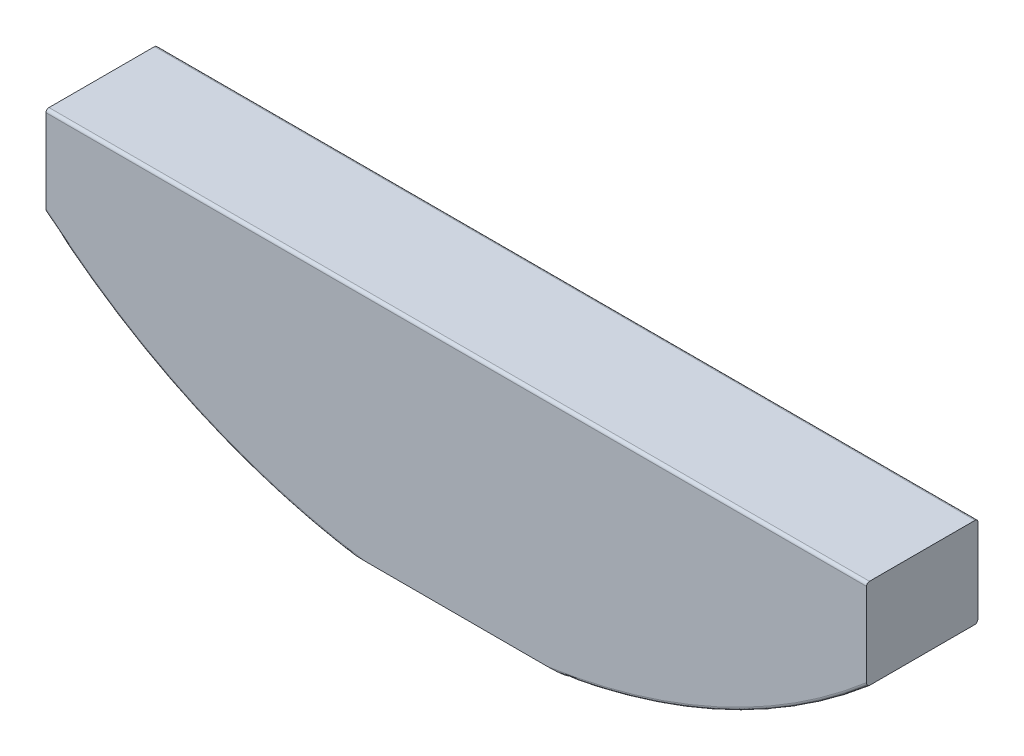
ISO-10303-21;
HEADER;
FILE_DESCRIPTION(('STEP AP214'),'2;1');
FILE_NAME('part.step','',(''),(''),'','','');
FILE_SCHEMA(('AUTOMOTIVE_DESIGN { 1 0 10303 214 1 1 1 1 }'));
ENDSEC;
DATA;
#1=APPLICATION_CONTEXT('core data for automotive mechanical design processes');
#2=APPLICATION_PROTOCOL_DEFINITION('international standard','automotive_design',2000,#1);
#3=PRODUCT_CONTEXT('',#1,'mechanical');
#4=PRODUCT('Part','Part','',(#3));
#5=PRODUCT_RELATED_PRODUCT_CATEGORY('part','',(#4));
#6=PRODUCT_DEFINITION_FORMATION('','',#4);
#7=PRODUCT_DEFINITION_CONTEXT('part definition',#1,'design');
#8=PRODUCT_DEFINITION('design','',#6,#7);
#9=PRODUCT_DEFINITION_SHAPE('','',#8);
#10=(LENGTH_UNIT() NAMED_UNIT(*) SI_UNIT(.MILLI.,.METRE.));
#11=(NAMED_UNIT(*) PLANE_ANGLE_UNIT() SI_UNIT($,.RADIAN.));
#12=(NAMED_UNIT(*) SI_UNIT($,.STERADIAN.) SOLID_ANGLE_UNIT());
#13=UNCERTAINTY_MEASURE_WITH_UNIT(LENGTH_MEASURE(1.E-05),#10,'distance_accuracy_value','');
#14=(GEOMETRIC_REPRESENTATION_CONTEXT(3) GLOBAL_UNCERTAINTY_ASSIGNED_CONTEXT((#13)) GLOBAL_UNIT_ASSIGNED_CONTEXT((#10,
#11,#12)) REPRESENTATION_CONTEXT('',''));
#15=CARTESIAN_POINT('',(0.,0.,0.));
#16=DIRECTION('',(0.,0.,1.));
#17=DIRECTION('',(1.,0.,0.));
#18=AXIS2_PLACEMENT_3D('',#15,#16,#17);
#19=CARTESIAN_POINT('',(0.,0.,4.7625));
#20=DIRECTION('',(0.,0.,-1.));
#21=DIRECTION('',(-1.,0.,0.));
#22=AXIS2_PLACEMENT_3D('',#19,#20,#21);
#23=CYLINDRICAL_SURFACE('',#22,26.9875);
#24=DIRECTION('',(0.,0.,-1.));
#25=VECTOR('',#24,1.);
#26=CARTESIAN_POINT('',(17.526,-20.5222922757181,4.7625));
#27=LINE('',#26,#25);
#28=CARTESIAN_POINT('',(17.526,-20.5222922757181,4.6355));
#29=VERTEX_POINT('',#28);
#30=CARTESIAN_POINT('',(17.526,-20.522292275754,0.127000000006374));
#31=VERTEX_POINT('',#30);
#32=EDGE_CURVE('E264',#29,#31,#27,.T.);
#33=ORIENTED_EDGE('',*,*,#32,.F.);
#34=CARTESIAN_POINT('',(0.,0.,4.6355));
#35=DIRECTION('',(0.,0.,1.));
#36=DIRECTION('',(1.,0.,0.));
#37=AXIS2_PLACEMENT_3D('',#34,#35,#36);
#38=CIRCLE('',#37,26.9875);
#39=CARTESIAN_POINT('',(4.70189522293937,-26.57475,4.6355));
#40=VERTEX_POINT('',#39);
#41=EDGE_CURVE('E152',#29,#40,#38,.F.);
#42=ORIENTED_EDGE('',*,*,#41,.T.);
#43=DIRECTION('',(0.,0.,-1.));
#44=VECTOR('',#43,1.);
#45=CARTESIAN_POINT('',(4.70189522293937,-26.57475,4.7625));
#46=LINE('',#45,#44);
#47=CARTESIAN_POINT('',(4.70189522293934,-26.57475,0.127));
#48=VERTEX_POINT('',#47);
#49=EDGE_CURVE('E142',#48,#40,#46,.F.);
#50=ORIENTED_EDGE('',*,*,#49,.F.);
#51=CARTESIAN_POINT('',(0.,0.,0.127));
#52=DIRECTION('',(0.,0.,1.));
#53=DIRECTION('',(1.,0.,0.));
#54=AXIS2_PLACEMENT_3D('',#51,#52,#53);
#55=CIRCLE('',#54,26.9875);
#56=EDGE_CURVE('E139',#48,#31,#55,.T.);
#57=ORIENTED_EDGE('',*,*,#56,.T.);
#58=EDGE_LOOP('',(#33,#42,#50,#57));
#59=FACE_BOUND('',#58,.T.);
#60=ADVANCED_FACE('F33',(#59),#23,.T.);
#61=CARTESIAN_POINT('',(0.,0.,4.7625));
#62=DIRECTION('',(0.,0.,1.));
#63=DIRECTION('',(1.,0.,0.));
#64=AXIS2_PLACEMENT_3D('',#61,#62,#63);
#65=PLANE('',#64);
#66=CARTESIAN_POINT('',(0.,0.,4.7625));
#67=DIRECTION('',(0.,0.,1.));
#68=DIRECTION('',(1.,0.,0.));
#69=AXIS2_PLACEMENT_3D('',#66,#67,#68);
#70=CIRCLE('',#69,26.8605);
#71=CARTESIAN_POINT('',(3.90757248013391,-26.57475,4.7625));
#72=VERTEX_POINT('',#71);
#73=CARTESIAN_POINT('',(17.526,-20.3549940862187,4.7625));
#74=VERTEX_POINT('',#73);
#75=EDGE_CURVE('E154',#72,#74,#70,.T.);
#76=ORIENTED_EDGE('',*,*,#75,.T.);
#77=DIRECTION('',(0.,1.,0.));
#78=VECTOR('',#77,1.);
#79=CARTESIAN_POINT('',(17.526,0.,4.7625));
#80=LINE('',#79,#78);
#81=CARTESIAN_POINT('',(17.526,-16.79575,4.7625));
#82=VERTEX_POINT('',#81);
#83=EDGE_CURVE('E218',#74,#82,#80,.T.);
#84=ORIENTED_EDGE('',*,*,#83,.T.);
#85=DIRECTION('',(-1.,0.,0.));
#86=VECTOR('',#85,1.);
#87=CARTESIAN_POINT('',(-21.2244653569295,-16.79575,4.7625));
#88=LINE('',#87,#86);
#89=CARTESIAN_POINT('',(-17.526,-16.79575,4.7625));
#90=VERTEX_POINT('',#89);
#91=EDGE_CURVE('E157',#82,#90,#88,.T.);
#92=ORIENTED_EDGE('',*,*,#91,.T.);
#93=DIRECTION('',(0.,1.,0.));
#94=VECTOR('',#93,1.);
#95=CARTESIAN_POINT('',(-17.526,0.,4.7625));
#96=LINE('',#95,#94);
#97=CARTESIAN_POINT('',(-17.526,-20.3549940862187,4.7625));
#98=VERTEX_POINT('',#97);
#99=EDGE_CURVE('E56',#98,#90,#96,.T.);
#100=ORIENTED_EDGE('',*,*,#99,.F.);
#101=CARTESIAN_POINT('',(-3.90757248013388,-26.57475,4.76250000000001));
#102=VERTEX_POINT('',#101);
#103=EDGE_CURVE('E155',#98,#102,#70,.T.);
#104=ORIENTED_EDGE('',*,*,#103,.T.);
#105=DIRECTION('',(1.,0.,0.));
#106=VECTOR('',#105,1.);
#107=CARTESIAN_POINT('',(0.,-26.57475,4.7625));
#108=LINE('',#107,#106);
#109=EDGE_CURVE('E199',#102,#72,#108,.T.);
#110=ORIENTED_EDGE('',*,*,#109,.T.);
#111=EDGE_LOOP('',(#76,#84,#92,#100,#104,#110));
#112=FACE_BOUND('',#111,.T.);
#113=ADVANCED_FACE('F187',(#112),#65,.T.);
#114=CARTESIAN_POINT('',(0.,0.,0.));
#115=DIRECTION('',(0.,0.,1.));
#116=DIRECTION('',(1.,0.,0.));
#117=AXIS2_PLACEMENT_3D('',#114,#115,#116);
#118=PLANE('',#117);
#119=DIRECTION('',(0.,1.,0.));
#120=VECTOR('',#119,1.);
#121=CARTESIAN_POINT('',(17.526,0.,0.));
#122=LINE('',#121,#120);
#123=CARTESIAN_POINT('',(17.526,-20.3549940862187,0.));
#124=VERTEX_POINT('',#123);
#125=CARTESIAN_POINT('',(17.526,-16.79575,0.));
#126=VERTEX_POINT('',#125);
#127=EDGE_CURVE('E49',#124,#126,#122,.T.);
#128=ORIENTED_EDGE('',*,*,#127,.F.);
#129=CARTESIAN_POINT('',(0.,0.,0.));
#130=DIRECTION('',(0.,0.,1.));
#131=DIRECTION('',(1.,0.,0.));
#132=AXIS2_PLACEMENT_3D('',#129,#130,#131);
#133=CIRCLE('',#132,26.8605);
#134=CARTESIAN_POINT('',(3.90757248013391,-26.57475,0.));
#135=VERTEX_POINT('',#134);
#136=EDGE_CURVE('E160',#124,#135,#133,.F.);
#137=ORIENTED_EDGE('',*,*,#136,.T.);
#138=DIRECTION('',(1.,0.,0.));
#139=VECTOR('',#138,1.);
#140=CARTESIAN_POINT('',(0.,-26.57475,0.));
#141=LINE('',#140,#139);
#142=CARTESIAN_POINT('',(-3.90757248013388,-26.57475,0.));
#143=VERTEX_POINT('',#142);
#144=EDGE_CURVE('E238',#143,#135,#141,.T.);
#145=ORIENTED_EDGE('',*,*,#144,.F.);
#146=CARTESIAN_POINT('',(-17.526,-20.3549940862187,0.));
#147=VERTEX_POINT('',#146);
#148=EDGE_CURVE('E159',#143,#147,#133,.F.);
#149=ORIENTED_EDGE('',*,*,#148,.T.);
#150=DIRECTION('',(0.,1.,0.));
#151=VECTOR('',#150,1.);
#152=CARTESIAN_POINT('',(-17.526,0.,0.));
#153=LINE('',#152,#151);
#154=CARTESIAN_POINT('',(-17.526,-16.79575,0.));
#155=VERTEX_POINT('',#154);
#156=EDGE_CURVE('E251',#147,#155,#153,.T.);
#157=ORIENTED_EDGE('',*,*,#156,.T.);
#158=DIRECTION('',(-1.,0.,0.));
#159=VECTOR('',#158,1.);
#160=CARTESIAN_POINT('',(0.,-16.79575,0.));
#161=LINE('',#160,#159);
#162=EDGE_CURVE('E162',#155,#126,#161,.F.);
#163=ORIENTED_EDGE('',*,*,#162,.T.);
#164=EDGE_LOOP('',(#128,#137,#145,#149,#157,#163));
#165=FACE_BOUND('',#164,.T.);
#166=ADVANCED_FACE('F250',(#165),#118,.F.);
#167=CARTESIAN_POINT('',(0.,0.,4.6355));
#168=DIRECTION('',(0.,0.,1.));
#169=DIRECTION('',(1.,0.,0.));
#170=AXIS2_PLACEMENT_3D('',#167,#168,#169);
#171=TOROIDAL_SURFACE('',#170,26.8605,0.127);
#172=ORIENTED_EDGE('',*,*,#41,.F.);
#173=CARTESIAN_POINT('',(17.526,-20.5206005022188,4.65353072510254));
#174=CARTESIAN_POINT('',(17.526,-20.519418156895,4.65979938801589));
#175=CARTESIAN_POINT('',(17.526,-20.5176243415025,4.66595162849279));
#176=CARTESIAN_POINT('',(17.526,-20.5129538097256,4.67782806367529));
#177=CARTESIAN_POINT('',(17.526,-20.5100763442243,4.68355195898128));
#178=CARTESIAN_POINT('',(17.526,-20.5034473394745,4.69440243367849));
#179=CARTESIAN_POINT('',(17.526,-20.4997025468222,4.6995331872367));
#180=CARTESIAN_POINT('',(17.526,-20.4915055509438,4.70918817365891));
#181=CARTESIAN_POINT('',(17.526,-20.4870531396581,4.71371222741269));
#182=CARTESIAN_POINT('',(17.526,-20.475553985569,4.72395375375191));
#183=CARTESIAN_POINT('',(17.526,-20.468216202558,4.72934512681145));
#184=CARTESIAN_POINT('',(17.526,-20.4527641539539,4.73887223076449));
#185=CARTESIAN_POINT('',(17.526,-20.4446483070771,4.74300533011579));
#186=CARTESIAN_POINT('',(17.526,-20.4257099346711,4.75098702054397));
#187=CARTESIAN_POINT('',(17.526,-20.4147359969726,4.75447635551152));
#188=CARTESIAN_POINT('',(17.526,-20.3923711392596,4.75961614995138));
#189=CARTESIAN_POINT('',(17.526,-20.3809799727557,4.76126550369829));
#190=CARTESIAN_POINT('',(17.526,-20.3579640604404,4.76278463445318));
#191=CARTESIAN_POINT('',(17.526,-20.3463381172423,4.76263606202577));
#192=CARTESIAN_POINT('',(17.526,-20.3232528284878,4.76051315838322));
#193=CARTESIAN_POINT('',(17.526,-20.3117934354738,4.75853935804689));
#194=CARTESIAN_POINT('',(17.526,-20.2907344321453,4.75307067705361));
#195=CARTESIAN_POINT('',(17.526,-20.2810788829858,4.74979158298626));
#196=CARTESIAN_POINT('',(17.526,-20.2624184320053,4.74172042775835));
#197=CARTESIAN_POINT('',(17.526,-20.2534127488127,4.73693022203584));
#198=CARTESIAN_POINT('',(17.526,-20.2384902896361,4.72712388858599));
#199=CARTESIAN_POINT('',(17.526,-20.23235341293,4.72244297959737));
#200=CARTESIAN_POINT('',(17.526,-20.2209013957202,4.71216274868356));
#201=CARTESIAN_POINT('',(17.526,-20.2155851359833,4.70656469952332));
#202=CARTESIAN_POINT('',(17.526,-20.206973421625,4.69565033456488));
#203=CARTESIAN_POINT('',(17.526,-20.2034859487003,4.69048607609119));
#204=CARTESIAN_POINT('',(17.526,-20.1974059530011,4.67965137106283));
#205=CARTESIAN_POINT('',(17.526,-20.1948129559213,4.67398119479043));
#206=CARTESIAN_POINT('',(17.526,-20.1906743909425,4.6622202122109));
#207=CARTESIAN_POINT('',(17.526,-20.1891363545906,4.65612671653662));
#208=CARTESIAN_POINT('',(17.526,-20.187262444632,4.64375759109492));
#209=CARTESIAN_POINT('',(17.526,-20.1869258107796,4.63748207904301));
#210=CARTESIAN_POINT('',(17.526,-20.1874479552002,4.62572637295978));
#211=CARTESIAN_POINT('',(17.526,-20.1881705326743,4.62023960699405));
#212=CARTESIAN_POINT('',(17.526,-20.190521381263,4.60946541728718));
#213=CARTESIAN_POINT('',(17.526,-20.1921496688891,4.60417799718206));
#214=CARTESIAN_POINT('',(17.526,-20.1962315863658,4.59388705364));
#215=CARTESIAN_POINT('',(17.526,-20.1986916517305,4.58888611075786));
#216=CARTESIAN_POINT('',(17.526,-20.2043111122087,4.5792964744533));
#217=CARTESIAN_POINT('',(17.526,-20.207470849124,4.57470798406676));
#218=CARTESIAN_POINT('',(17.526,-20.2158220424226,4.5641514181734));
#219=CARTESIAN_POINT('',(17.526,-20.2213087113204,4.55841622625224));
#220=CARTESIAN_POINT('',(17.526,-20.2331413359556,4.54791127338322));
#221=CARTESIAN_POINT('',(17.526,-20.2394890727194,4.54314356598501));
#222=CARTESIAN_POINT('',(17.526,-20.2548029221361,4.53327307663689));
#223=CARTESIAN_POINT('',(17.526,-20.2639820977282,4.52850130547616));
#224=CARTESIAN_POINT('',(17.526,-20.2829828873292,4.52050763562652));
#225=CARTESIAN_POINT('',(17.526,-20.2928049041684,4.51728671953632));
#226=CARTESIAN_POINT('',(17.526,-20.3129864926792,4.51228415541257));
#227=CARTESIAN_POINT('',(17.526,-20.3233524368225,4.51052846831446));
#228=CARTESIAN_POINT('',(17.526,-20.3442304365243,4.50851160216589));
#229=CARTESIAN_POINT('',(17.526,-20.3547425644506,4.50825119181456));
#230=CARTESIAN_POINT('',(17.526,-20.3774504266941,4.5093034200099));
#231=CARTESIAN_POINT('',(17.526,-20.3896346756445,4.51088554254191));
#232=CARTESIAN_POINT('',(17.526,-20.4135499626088,4.51614047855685));
#233=CARTESIAN_POINT('',(17.526,-20.4252813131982,4.51981182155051));
#234=CARTESIAN_POINT('',(17.526,-20.4447310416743,4.52804487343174));
#235=CARTESIAN_POINT('',(17.526,-20.4526695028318,4.53208852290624));
#236=CARTESIAN_POINT('',(17.526,-20.4678059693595,4.54138352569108));
#237=CARTESIAN_POINT('',(17.526,-20.4750051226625,4.54663296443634));
#238=CARTESIAN_POINT('',(17.526,-20.4868903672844,4.55708989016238));
#239=CARTESIAN_POINT('',(17.526,-20.4917834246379,4.562061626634));
#240=CARTESIAN_POINT('',(17.526,-20.5007020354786,4.57273323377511));
#241=CARTESIAN_POINT('',(17.526,-20.5047285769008,4.57843226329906));
#242=CARTESIAN_POINT('',(17.526,-20.511125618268,4.58951012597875));
#243=CARTESIAN_POINT('',(17.526,-20.5136577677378,4.59479525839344));
#244=CARTESIAN_POINT('',(17.526,-20.517805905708,4.60571544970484));
#245=CARTESIAN_POINT('',(17.526,-20.5194223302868,4.6113503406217));
#246=CARTESIAN_POINT('',(17.526,-20.5216831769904,4.62308457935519));
#247=CARTESIAN_POINT('',(17.526,-20.5222795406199,4.62919337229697));
#248=CARTESIAN_POINT('',(17.526,-20.522304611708,4.64141396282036));
#249=CARTESIAN_POINT('',(17.526,-20.5217331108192,4.64752576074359));
#250=CARTESIAN_POINT('',(17.526,-20.5206005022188,4.65353072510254));
#251=B_SPLINE_CURVE_WITH_KNOTS('',3,(#173,#174,#175,#176,#177,#178,#179,#180,#181,#182,#183,
#184,#185,#186,#187,#188,#189,#190,#191,#192,#193,#194,#195,#196,#197,#198,#199,#200,#201,#202,
#203,#204,#205,#206,#207,#208,#209,#210,#211,#212,#213,#214,#215,#216,#217,#218,#219,#220,#221,
#222,#223,#224,#225,#226,#227,#228,#229,#230,#231,#232,#233,#234,#235,#236,#237,#238,#239,#240,
#241,#242,#243,#244,#245,#246,#247,#248,#249,#250),.UNSPECIFIED.,.T.,.F.,(4,2,2,2,2,2,2,2,2,2,2,
2,2,2,2,2,2,2,2,2,2,2,2,2,2,2,2,2,2,2,2,2,2,2,2,2,2,2,4),(0.,0.0191098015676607,
0.038232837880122,0.0572118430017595,0.0761964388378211,0.103363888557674,0.13058777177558,
0.164955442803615,0.199343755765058,0.234083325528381,0.268812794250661,0.299290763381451,
0.329731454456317,0.352805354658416,0.375847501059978,0.394468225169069,0.413079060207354,
0.431821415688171,0.450551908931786,0.467075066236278,0.483598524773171,0.500252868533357,
0.516915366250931,0.540595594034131,0.56432557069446,0.59519742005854,0.62608880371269,
0.657516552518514,0.688960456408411,0.725646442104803,0.762306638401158,0.788941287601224,
0.815533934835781,0.836383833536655,0.857209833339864,0.874717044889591,0.892215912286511,
0.910518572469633,0.928824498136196),.UNSPECIFIED.);
#252=EDGE_CURVE('E216',#29,#74,#251,.T.);
#253=ORIENTED_EDGE('',*,*,#252,.T.);
#254=ORIENTED_EDGE('',*,*,#75,.F.);
#255=CARTESIAN_POINT('',(4.08445093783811,-26.57475,4.51125327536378));
#256=CARTESIAN_POINT('',(4.04211470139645,-26.57475,4.50989152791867));
#257=CARTESIAN_POINT('',(3.99976142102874,-26.57475,4.50906759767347));
#258=CARTESIAN_POINT('',(3.91506836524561,-26.57475,4.50835191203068));
#259=CARTESIAN_POINT('',(3.87272859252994,-26.57475,4.50845972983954));
#260=CARTESIAN_POINT('',(3.74566027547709,-26.57475,4.51004439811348));
#261=CARTESIAN_POINT('',(3.66094277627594,-26.57475,4.51278409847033));
#262=CARTESIAN_POINT('',(3.53398372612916,-26.57475,4.51940350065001));
#263=CARTESIAN_POINT('',(3.49167192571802,-26.57475,4.52202934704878));
#264=CARTESIAN_POINT('',(3.407117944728,-26.57475,4.52822038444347));
#265=CARTESIAN_POINT('',(3.3648757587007,-26.57475,4.53178549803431));
#266=CARTESIAN_POINT('',(3.2805050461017,-26.57475,4.54007507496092));
#267=CARTESIAN_POINT('',(3.23837651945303,-26.57475,4.54479953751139));
#268=CARTESIAN_POINT('',(3.15434655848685,-26.57475,4.55587470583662));
#269=CARTESIAN_POINT('',(3.11244498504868,-26.57475,4.56222426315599));
#270=CARTESIAN_POINT('',(3.04682166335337,-26.57475,4.57477026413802));
#271=CARTESIAN_POINT('',(3.02290725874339,-26.57475,4.57989535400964));
#272=CARTESIAN_POINT('',(2.98745732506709,-26.57475,4.5893281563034));
#273=CARTESIAN_POINT('',(2.97570744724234,-26.57475,4.5927645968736));
#274=CARTESIAN_POINT('',(2.95683850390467,-26.57475,4.59930321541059));
#275=CARTESIAN_POINT('',(2.94960053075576,-26.57475,4.60206630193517));
#276=CARTESIAN_POINT('',(2.93611166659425,-26.57475,4.60808894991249));
#277=CARTESIAN_POINT('',(2.92983298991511,-26.57475,4.61127470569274));
#278=CARTESIAN_POINT('',(2.92252003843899,-26.57475,4.61622752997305));
#279=CARTESIAN_POINT('',(2.9210343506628,-26.57475,4.61730704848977));
#280=CARTESIAN_POINT('',(2.91817597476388,-26.57475,4.6196103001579));
#281=CARTESIAN_POINT('',(2.91680325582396,-26.57475,4.62083399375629));
#282=CARTESIAN_POINT('',(2.91463629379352,-26.57475,4.62307071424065));
#283=CARTESIAN_POINT('',(2.91379274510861,-26.57475,4.6240353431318));
#284=CARTESIAN_POINT('',(2.91224885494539,-26.57475,4.62607410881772));
#285=CARTESIAN_POINT('',(2.91154819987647,-26.57475,4.62714799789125));
#286=CARTESIAN_POINT('',(2.91055099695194,-26.57475,4.62905516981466));
#287=CARTESIAN_POINT('',(2.9101966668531,-26.57475,4.62985781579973));
#288=CARTESIAN_POINT('',(2.90962100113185,-26.57475,4.63150953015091));
#289=CARTESIAN_POINT('',(2.90939946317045,-26.57475,4.63235852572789));
#290=CARTESIAN_POINT('',(2.90911391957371,-26.57475,4.63409094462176));
#291=CARTESIAN_POINT('',(2.90905126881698,-26.57475,4.63497459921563));
#292=CARTESIAN_POINT('',(2.90909667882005,-26.57475,4.63673766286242));
#293=CARTESIAN_POINT('',(2.90920478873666,-26.57475,4.6376170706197));
#294=CARTESIAN_POINT('',(2.90955640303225,-26.57475,4.6392490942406));
#295=CARTESIAN_POINT('',(2.90978424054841,-26.57475,4.64000523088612));
#296=CARTESIAN_POINT('',(2.91034300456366,-26.57475,4.64147775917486));
#297=CARTESIAN_POINT('',(2.91067396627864,-26.57475,4.64219413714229));
#298=CARTESIAN_POINT('',(2.91170890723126,-26.57475,4.64412857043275));
#299=CARTESIAN_POINT('',(2.91250170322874,-26.57475,4.64529875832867));
#300=CARTESIAN_POINT('',(2.9142507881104,-26.57475,4.64751014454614));
#301=CARTESIAN_POINT('',(2.91520769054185,-26.57475,4.64855083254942));
#302=CARTESIAN_POINT('',(2.91891920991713,-26.57475,4.65219735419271));
#303=CARTESIAN_POINT('',(2.92198260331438,-26.57475,4.654480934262));
#304=CARTESIAN_POINT('',(2.9283769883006,-26.57475,4.65863381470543));
#305=CARTESIAN_POINT('',(2.93170968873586,-26.57475,4.66050013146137));
#306=CARTESIAN_POINT('',(2.94194902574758,-26.57475,4.66572852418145));
#307=CARTESIAN_POINT('',(2.94905820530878,-26.57475,4.66869212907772));
#308=CARTESIAN_POINT('',(2.96347812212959,-26.57475,4.6740910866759));
#309=CARTESIAN_POINT('',(2.97078939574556,-26.57475,4.67652484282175));
#310=CARTESIAN_POINT('',(2.9928853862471,-26.57475,4.68332092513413));
#311=CARTESIAN_POINT('',(3.00782592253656,-26.57475,4.68717545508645));
#312=CARTESIAN_POINT('',(3.05255000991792,-26.57475,4.69764802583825));
#313=CARTESIAN_POINT('',(3.08254838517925,-26.57475,4.7032782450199));
#314=CARTESIAN_POINT('',(3.14278522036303,-26.57475,4.71327495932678));
#315=CARTESIAN_POINT('',(3.17302396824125,-26.57475,4.71763958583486));
#316=CARTESIAN_POINT('',(3.23357555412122,-26.57475,4.72550357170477));
#317=CARTESIAN_POINT('',(3.26388825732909,-26.57475,4.72900397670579));
#318=CARTESIAN_POINT('',(3.32456038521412,-26.57475,4.73535863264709));
#319=CARTESIAN_POINT('',(3.3549197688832,-26.57475,4.73821328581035));
#320=CARTESIAN_POINT('',(3.445986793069,-26.57475,4.74597656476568));
#321=CARTESIAN_POINT('',(3.50676248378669,-26.57475,4.75009404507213));
#322=CARTESIAN_POINT('',(3.62842603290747,-26.57475,4.75659279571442));
#323=CARTESIAN_POINT('',(3.68931392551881,-26.57475,4.75897339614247));
#324=CARTESIAN_POINT('',(3.81103724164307,-26.57475,4.76202809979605));
#325=CARTESIAN_POINT('',(3.87187259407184,-26.57475,4.76270491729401));
#326=CARTESIAN_POINT('',(3.99351641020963,-26.57475,4.76218922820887));
#327=CARTESIAN_POINT('',(4.05432487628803,-26.57475,4.76099732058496));
#328=CARTESIAN_POINT('',(4.17575452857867,-26.57475,4.75633715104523));
#329=CARTESIAN_POINT('',(4.23637585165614,-26.57475,4.75287318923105));
#330=CARTESIAN_POINT('',(4.32724897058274,-26.57475,4.74518975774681));
#331=CARTESIAN_POINT('',(4.35760488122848,-26.57475,4.74220358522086));
#332=CARTESIAN_POINT('',(4.41816951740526,-26.57475,4.73512722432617));
#333=CARTESIAN_POINT('',(4.44837834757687,-26.57475,4.73103799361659));
#334=CARTESIAN_POINT('',(4.49357955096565,-26.57475,4.72365913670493));
#335=CARTESIAN_POINT('',(4.50867199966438,-26.57475,4.72098232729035));
#336=CARTESIAN_POINT('',(4.53878103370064,-26.57475,4.71507592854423));
#337=CARTESIAN_POINT('',(4.55379743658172,-26.57475,4.71184536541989));
#338=CARTESIAN_POINT('',(4.58354143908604,-26.57475,4.70462698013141));
#339=CARTESIAN_POINT('',(4.59827027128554,-26.57475,4.70064413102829));
#340=CARTESIAN_POINT('',(4.62735313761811,-26.57475,4.69150880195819));
#341=CARTESIAN_POINT('',(4.64170835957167,-26.57475,4.68636071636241));
#342=CARTESIAN_POINT('',(4.66105459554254,-26.57475,4.67741212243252));
#343=CARTESIAN_POINT('',(4.6665160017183,-26.57475,4.67464422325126));
#344=CARTESIAN_POINT('',(4.67709875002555,-26.57475,4.66846793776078));
#345=CARTESIAN_POINT('',(4.68222015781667,-26.57475,4.66505967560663));
#346=CARTESIAN_POINT('',(4.68926795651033,-26.57475,4.65910805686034));
#347=CARTESIAN_POINT('',(4.69152557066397,-26.57475,4.65696555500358));
#348=CARTESIAN_POINT('',(4.69560690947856,-26.57475,4.65230532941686));
#349=CARTESIAN_POINT('',(4.69743446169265,-26.57475,4.64979126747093));
#350=CARTESIAN_POINT('',(4.69950186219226,-26.57475,4.64585298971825));
#351=CARTESIAN_POINT('',(4.70006003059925,-26.57475,4.64459800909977));
#352=CARTESIAN_POINT('',(4.70097307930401,-26.57475,4.64201532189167));
#353=CARTESIAN_POINT('',(4.7013281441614,-26.57475,4.64068768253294));
#354=CARTESIAN_POINT('',(4.70179810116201,-26.57475,4.63797851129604));
#355=CARTESIAN_POINT('',(4.70191109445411,-26.57475,4.63659663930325));
#356=CARTESIAN_POINT('',(4.70187571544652,-26.57475,4.63383607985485));
#357=CARTESIAN_POINT('',(4.70172730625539,-26.57475,4.63245739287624));
#358=CARTESIAN_POINT('',(4.70121286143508,-26.57475,4.62986836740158));
#359=CARTESIAN_POINT('',(4.70086701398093,-26.57475,4.62865385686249));
#360=CARTESIAN_POINT('',(4.70000627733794,-26.57475,4.62628720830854));
#361=CARTESIAN_POINT('',(4.69949131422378,-26.57475,4.62513509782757));
#362=CARTESIAN_POINT('',(4.69790672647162,-26.57475,4.6220950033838));
#363=CARTESIAN_POINT('',(4.69670507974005,-26.57475,4.6202763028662));
#364=CARTESIAN_POINT('',(4.69404454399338,-26.57475,4.61683766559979));
#365=CARTESIAN_POINT('',(4.69258474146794,-26.57475,4.61521847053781));
#366=CARTESIAN_POINT('',(4.68715100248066,-26.57475,4.60979397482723));
#367=CARTESIAN_POINT('',(4.68274523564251,-26.57475,4.60643082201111));
#368=CARTESIAN_POINT('',(4.6735252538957,-26.57475,4.60032514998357));
#369=CARTESIAN_POINT('',(4.66870857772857,-26.57475,4.59758679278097));
#370=CARTESIAN_POINT('',(4.65485868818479,-26.57475,4.59045347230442));
#371=CARTESIAN_POINT('',(4.64558619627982,-26.57475,4.58652559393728));
#372=CARTESIAN_POINT('',(4.62675492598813,-26.57475,4.57941344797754));
#373=CARTESIAN_POINT('',(4.61719542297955,-26.57475,4.57623127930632));
#374=CARTESIAN_POINT('',(4.58826920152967,-26.57475,4.56742502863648));
#375=CARTESIAN_POINT('',(4.56867617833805,-26.57475,4.5625502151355));
#376=CARTESIAN_POINT('',(4.51093522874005,-26.57475,4.54984773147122));
#377=CARTESIAN_POINT('',(4.47248701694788,-26.57475,4.54349346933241));
#378=CARTESIAN_POINT('',(4.39526357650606,-26.57475,4.53286906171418));
#379=CARTESIAN_POINT('',(4.35648788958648,-26.57475,4.52860262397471));
#380=CARTESIAN_POINT('',(4.27885420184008,-26.57475,4.52153034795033));
#381=CARTESIAN_POINT('',(4.23999636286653,-26.57475,4.51872270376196));
#382=CARTESIAN_POINT('',(4.16224743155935,-26.57475,4.51421025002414));
#383=CARTESIAN_POINT('',(4.12335638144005,-26.57475,4.51250467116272));
#384=CARTESIAN_POINT('',(4.08445093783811,-26.57475,4.51125327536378));
#385=B_SPLINE_CURVE_WITH_KNOTS('',3,(#255,#256,#257,#258,#259,#260,#261,#262,#263,#264,#265,
#266,#267,#268,#269,#270,#271,#272,#273,#274,#275,#276,#277,#278,#279,#280,#281,#282,#283,#284,
#285,#286,#287,#288,#289,#290,#291,#292,#293,#294,#295,#296,#297,#298,#299,#300,#301,#302,#303,
#304,#305,#306,#307,#308,#309,#310,#311,#312,#313,#314,#315,#316,#317,#318,#319,#320,#321,#322,
#323,#324,#325,#326,#327,#328,#329,#330,#331,#332,#333,#334,#335,#336,#337,#338,#339,#340,#341,
#342,#343,#344,#345,#346,#347,#348,#349,#350,#351,#352,#353,#354,#355,#356,#357,#358,#359,#360,
#361,#362,#363,#364,#365,#366,#367,#368,#369,#370,#371,#372,#373,#374,#375,#376,#377,#378,#379,
#380,#381,#382,#383,#384),.UNSPECIFIED.,.T.,.F.,(4,2,2,2,2,2,2,2,2,2,2,2,2,2,2,2,2,2,2,2,2,2,2,
2,2,2,2,2,2,2,2,2,2,2,2,2,2,2,2,2,2,2,2,2,2,2,2,2,2,2,2,2,2,2,2,2,2,2,2,2,2,2,2,2,4),(0.,
0.127071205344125,0.254084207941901,0.50829028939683,0.635463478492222,0.762626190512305,
0.8897888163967,1.01686182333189,1.09018292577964,1.12686581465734,1.15010428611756,
1.1710965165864,1.17660007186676,1.18210212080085,1.18593825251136,1.18976587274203,
1.19238892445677,1.19500796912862,1.19764927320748,1.20029133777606,1.20265166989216,
1.20501280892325,1.20922832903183,1.21345996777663,1.22483231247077,1.23628354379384,
1.25932744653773,1.28243985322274,1.32868517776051,1.42019461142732,1.51183847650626,
1.60337091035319,1.69484617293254,1.87755759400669,2.06033944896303,2.24282993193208,
2.42526193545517,2.60734965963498,2.69884528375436,2.79026172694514,2.83624018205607,
2.88230033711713,2.92806603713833,2.97366193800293,2.99201535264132,3.01036521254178,
3.01967684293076,3.02890216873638,3.03300903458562,3.03711216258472,3.04124736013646,
3.04538314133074,3.04915687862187,3.05293226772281,3.05943351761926,3.0659582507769,
3.08245760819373,3.09906385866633,3.12919433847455,3.15940863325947,3.21990652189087,
3.33670046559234,3.45370107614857,3.57055649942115,3.68733026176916),.UNSPECIFIED.);
#386=EDGE_CURVE('E137',#72,#40,#385,.T.);
#387=ORIENTED_EDGE('',*,*,#386,.T.);
#388=EDGE_LOOP('',(#172,#253,#254,#387));
#389=FACE_BOUND('',#388,.T.);
#390=ADVANCED_FACE('F35',(#389),#171,.T.);
#391=CARTESIAN_POINT('',(0.,0.,0.127));
#392=DIRECTION('',(0.,0.,1.));
#393=DIRECTION('',(1.,0.,0.));
#394=AXIS2_PLACEMENT_3D('',#391,#392,#393);
#395=TOROIDAL_SURFACE('',#394,26.8605,0.127);
#396=ORIENTED_EDGE('',*,*,#136,.F.);
#397=CARTESIAN_POINT('',(17.526,-20.5206005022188,0.108969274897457));
#398=CARTESIAN_POINT('',(17.526,-20.5216469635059,0.114515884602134));
#399=CARTESIAN_POINT('',(17.526,-20.5222145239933,0.120152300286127));
#400=CARTESIAN_POINT('',(17.526,-20.5223549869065,0.131437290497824));
#401=CARTESIAN_POINT('',(17.526,-20.5219281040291,0.13708586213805));
#402=CARTESIAN_POINT('',(17.526,-20.520110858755,0.148212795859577));
#403=CARTESIAN_POINT('',(17.526,-20.5187222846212,0.153691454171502));
#404=CARTESIAN_POINT('',(17.526,-20.5150712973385,0.164347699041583));
#405=CARTESIAN_POINT('',(17.526,-20.5128085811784,0.169525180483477));
#406=CARTESIAN_POINT('',(17.526,-20.5074514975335,0.179624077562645));
#407=CARTESIAN_POINT('',(17.526,-20.5043345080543,0.18453338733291));
#408=CARTESIAN_POINT('',(17.526,-20.4974414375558,0.193861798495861));
#409=CARTESIAN_POINT('',(17.526,-20.4936650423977,0.198280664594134));
#410=CARTESIAN_POINT('',(17.526,-20.4836625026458,0.208573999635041));
#411=CARTESIAN_POINT('',(17.526,-20.4771236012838,0.21414571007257));
#412=CARTESIAN_POINT('',(17.526,-20.4632279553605,0.224158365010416));
#413=CARTESIAN_POINT('',(17.526,-20.4558694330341,0.2285967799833));
#414=CARTESIAN_POINT('',(17.526,-20.4384377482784,0.2374704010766));
#415=CARTESIAN_POINT('',(17.526,-20.4281843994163,0.24155145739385));
#416=CARTESIAN_POINT('',(17.526,-20.4071601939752,0.247990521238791));
#417=CARTESIAN_POINT('',(17.526,-20.3963891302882,0.250347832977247));
#418=CARTESIAN_POINT('',(17.526,-20.3744731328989,0.253425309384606));
#419=CARTESIAN_POINT('',(17.526,-20.3633251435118,0.254123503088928));
#420=CARTESIAN_POINT('',(17.526,-20.3410413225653,0.253840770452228));
#421=CARTESIAN_POINT('',(17.526,-20.3299055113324,0.252858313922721));
#422=CARTESIAN_POINT('',(17.526,-20.3066902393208,0.248984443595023));
#423=CARTESIAN_POINT('',(17.526,-20.2946432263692,0.24589325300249));
#424=CARTESIAN_POINT('',(17.526,-20.2713393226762,0.237508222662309));
#425=CARTESIAN_POINT('',(17.526,-20.2600808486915,0.232218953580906));
#426=CARTESIAN_POINT('',(17.526,-20.2428486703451,0.221688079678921));
#427=CARTESIAN_POINT('',(17.526,-20.2364496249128,0.217138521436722));
#428=CARTESIAN_POINT('',(17.526,-20.2244464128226,0.207089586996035));
#429=CARTESIAN_POINT('',(17.526,-20.2188409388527,0.201591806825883));
#430=CARTESIAN_POINT('',(17.526,-20.2096635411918,0.190796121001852));
#431=CARTESIAN_POINT('',(17.526,-20.2059074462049,0.185655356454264));
#432=CARTESIAN_POINT('',(17.526,-20.1992870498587,0.174823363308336));
#433=CARTESIAN_POINT('',(17.526,-20.1964223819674,0.169132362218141));
#434=CARTESIAN_POINT('',(17.526,-20.1917500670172,0.15727443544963));
#435=CARTESIAN_POINT('',(17.526,-20.1899508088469,0.151104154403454));
#436=CARTESIAN_POINT('',(17.526,-20.1875927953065,0.138531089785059));
#437=CARTESIAN_POINT('',(17.526,-20.1870330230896,0.132128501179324));
#438=CARTESIAN_POINT('',(17.526,-20.1871895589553,0.12017669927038));
#439=CARTESIAN_POINT('',(17.526,-20.1877493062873,0.114624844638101));
#440=CARTESIAN_POINT('',(17.526,-20.1898021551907,0.103698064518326));
#441=CARTESIAN_POINT('',(17.526,-20.1912952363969,0.098323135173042));
#442=CARTESIAN_POINT('',(17.526,-20.1951090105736,0.087921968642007));
#443=CARTESIAN_POINT('',(17.526,-20.1974238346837,0.0828935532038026));
#444=CARTESIAN_POINT('',(17.526,-20.2027644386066,0.0732321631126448));
#445=CARTESIAN_POINT('',(17.526,-20.2057905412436,0.0685993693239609));
#446=CARTESIAN_POINT('',(17.526,-20.2137775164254,0.0579961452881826));
#447=CARTESIAN_POINT('',(17.526,-20.2190260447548,0.0522418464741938));
#448=CARTESIAN_POINT('',(17.526,-20.2303894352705,0.0416615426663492));
#449=CARTESIAN_POINT('',(17.526,-20.2365060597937,0.0368374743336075));
#450=CARTESIAN_POINT('',(17.526,-20.2513096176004,0.0267951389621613));
#451=CARTESIAN_POINT('',(17.526,-20.2602145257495,0.0218986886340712));
#452=CARTESIAN_POINT('',(17.526,-20.2786904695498,0.0136118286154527));
#453=CARTESIAN_POINT('',(17.526,-20.2882619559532,0.0102224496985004));
#454=CARTESIAN_POINT('',(17.526,-20.3079714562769,0.00483451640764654));
#455=CARTESIAN_POINT('',(17.526,-20.3181165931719,0.0028622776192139));
#456=CARTESIAN_POINT('',(17.526,-20.3385838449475,0.000366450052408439));
#457=CARTESIAN_POINT('',(17.526,-20.3489060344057,-0.00015651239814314));
#458=CARTESIAN_POINT('',(17.526,-20.3713784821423,0.000272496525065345));
#459=CARTESIAN_POINT('',(17.526,-20.3835243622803,0.00150600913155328));
#460=CARTESIAN_POINT('',(17.526,-20.4074356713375,0.0060235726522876));
#461=CARTESIAN_POINT('',(17.526,-20.419201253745,0.00930678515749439));
#462=CARTESIAN_POINT('',(17.526,-20.4391062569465,0.0169454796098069));
#463=CARTESIAN_POINT('',(17.526,-20.4474243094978,0.0208367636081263));
#464=CARTESIAN_POINT('',(17.526,-20.4633360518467,0.0298921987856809));
#465=CARTESIAN_POINT('',(17.526,-20.4709309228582,0.0350542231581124));
#466=CARTESIAN_POINT('',(17.526,-20.4834822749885,0.0453863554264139));
#467=CARTESIAN_POINT('',(17.526,-20.4886498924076,0.05029938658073));
#468=CARTESIAN_POINT('',(17.526,-20.4981293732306,0.0608980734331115));
#469=CARTESIAN_POINT('',(17.526,-20.502441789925,0.0665832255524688));
#470=CARTESIAN_POINT('',(17.526,-20.5096709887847,0.0781805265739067));
#471=CARTESIAN_POINT('',(17.526,-20.5126700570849,0.0840408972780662));
#472=CARTESIAN_POINT('',(17.526,-20.5175269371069,0.0962173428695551));
#473=CARTESIAN_POINT('',(17.526,-20.5193861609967,0.102532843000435));
#474=CARTESIAN_POINT('',(17.526,-20.5206005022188,0.108969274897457));
#475=B_SPLINE_CURVE_WITH_KNOTS('',3,(#397,#398,#399,#400,#401,#402,#403,#404,#405,#406,#407,
#408,#409,#410,#411,#412,#413,#414,#415,#416,#417,#418,#419,#420,#421,#422,#423,#424,#425,#426,
#427,#428,#429,#430,#431,#432,#433,#434,#435,#436,#437,#438,#439,#440,#441,#442,#443,#444,#445,
#446,#447,#448,#449,#450,#451,#452,#453,#454,#455,#456,#457,#458,#459,#460,#461,#462,#463,#464,
#465,#466,#467,#468,#469,#470,#471,#472,#473,#474),.UNSPECIFIED.,.T.,.F.,(4,2,2,2,2,2,2,2,2,2,2,
2,2,2,2,2,2,2,2,2,2,2,2,2,2,2,2,2,2,2,2,2,2,2,2,2,2,2,4),(0.,0.0169102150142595,
0.033816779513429,0.0506919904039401,0.0675730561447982,0.0849535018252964,0.102342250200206,
0.127972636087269,0.153659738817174,0.186593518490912,0.219540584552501,0.252921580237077,
0.286332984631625,0.323452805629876,0.360495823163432,0.383971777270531,0.407408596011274,
0.426434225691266,0.445452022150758,0.464617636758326,0.483767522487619,0.5004257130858,
0.517083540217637,0.533624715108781,0.550173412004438,0.573410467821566,0.596695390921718,
0.627020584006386,0.657366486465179,0.688262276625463,0.719171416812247,0.755627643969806,
0.792068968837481,0.819522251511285,0.846929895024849,0.868242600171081,0.889541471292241,
0.909188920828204,0.928811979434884),.UNSPECIFIED.);
#476=EDGE_CURVE('E270',#124,#31,#475,.T.);
#477=ORIENTED_EDGE('',*,*,#476,.T.);
#478=ORIENTED_EDGE('',*,*,#56,.F.);
#479=CARTESIAN_POINT('',(4.08445093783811,-26.57475,0.251246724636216));
#480=CARTESIAN_POINT('',(4.12675956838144,-26.57475,0.249884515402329));
#481=CARTESIAN_POINT('',(4.16905139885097,-26.57475,0.247990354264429));
#482=CARTESIAN_POINT('',(4.25361365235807,-26.57475,0.242864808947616));
#483=CARTESIAN_POINT('',(4.29588396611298,-26.57475,0.239631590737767));
#484=CARTESIAN_POINT('',(4.38010607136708,-26.57475,0.231394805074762));
#485=CARTESIAN_POINT('',(4.42205846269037,-26.57475,0.226398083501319));
#486=CARTESIAN_POINT('',(4.48461229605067,-26.57475,0.216739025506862));
#487=CARTESIAN_POINT('',(4.50537967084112,-26.57475,0.213163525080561));
#488=CARTESIAN_POINT('',(4.54670578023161,-26.57475,0.204980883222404));
#489=CARTESIAN_POINT('',(4.56726465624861,-26.57475,0.200374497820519));
#490=CARTESIAN_POINT('',(4.60282013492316,-26.57475,0.19081063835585));
#491=CARTESIAN_POINT('',(4.61791530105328,-26.57475,0.186232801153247));
#492=CARTESIAN_POINT('',(4.64524972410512,-26.57475,0.176232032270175));
#493=CARTESIAN_POINT('',(4.65757021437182,-26.57475,0.171048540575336));
#494=CARTESIAN_POINT('',(4.67578802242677,-26.57475,0.16086359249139));
#495=CARTESIAN_POINT('',(4.68213351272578,-26.57475,0.156778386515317));
#496=CARTESIAN_POINT('',(4.68946995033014,-26.57475,0.150379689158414));
#497=CARTESIAN_POINT('',(4.69110147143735,-26.57475,0.148825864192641));
#498=CARTESIAN_POINT('',(4.69415788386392,-26.57475,0.145524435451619));
#499=CARTESIAN_POINT('',(4.69558306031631,-26.57475,0.143777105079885));
#500=CARTESIAN_POINT('',(4.6977212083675,-26.57475,0.140630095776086));
#501=CARTESIAN_POINT('',(4.69851848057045,-26.57475,0.139288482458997));
#502=CARTESIAN_POINT('',(4.6998975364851,-26.57475,0.136498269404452));
#503=CARTESIAN_POINT('',(4.70047972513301,-26.57475,0.135049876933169));
#504=CARTESIAN_POINT('',(4.70128756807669,-26.57475,0.132328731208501));
#505=CARTESIAN_POINT('',(4.70155768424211,-26.57475,0.131069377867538));
#506=CARTESIAN_POINT('',(4.70187933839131,-26.57475,0.128523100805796));
#507=CARTESIAN_POINT('',(4.70193104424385,-26.57475,0.127236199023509));
#508=CARTESIAN_POINT('',(4.70181003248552,-26.57475,0.124673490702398));
#509=CARTESIAN_POINT('',(4.70163734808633,-26.57475,0.123397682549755));
#510=CARTESIAN_POINT('',(4.70108710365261,-26.57475,0.120891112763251));
#511=CARTESIAN_POINT('',(4.70070932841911,-26.57475,0.119660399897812));
#512=CARTESIAN_POINT('',(4.69959135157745,-26.57475,0.11677003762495));
#513=CARTESIAN_POINT('',(4.69876585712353,-26.57475,0.115143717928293));
#514=CARTESIAN_POINT('',(4.69687295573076,-26.57475,0.112039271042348));
#515=CARTESIAN_POINT('',(4.69580491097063,-26.57475,0.110561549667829));
#516=CARTESIAN_POINT('',(4.69253947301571,-26.57475,0.106556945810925));
#517=CARTESIAN_POINT('',(4.69014704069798,-26.57475,0.104191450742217));
#518=CARTESIAN_POINT('',(4.68506945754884,-26.57475,0.099803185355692));
#519=CARTESIAN_POINT('',(4.68238338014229,-26.57475,0.0977815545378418));
#520=CARTESIAN_POINT('',(4.67042403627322,-26.57475,0.0895494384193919));
#521=CARTESIAN_POINT('',(4.66035798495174,-26.57475,0.0845302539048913));
#522=CARTESIAN_POINT('',(4.63974551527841,-26.57475,0.0756348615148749));
#523=CARTESIAN_POINT('',(4.6291963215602,-26.57475,0.0717665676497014));
#524=CARTESIAN_POINT('',(4.60606453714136,-26.57475,0.0641672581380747));
#525=CARTESIAN_POINT('',(4.5934371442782,-26.57475,0.0605675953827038));
#526=CARTESIAN_POINT('',(4.56801736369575,-26.57475,0.0539987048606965));
#527=CARTESIAN_POINT('',(4.5552248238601,-26.57475,0.0510301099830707));
#528=CARTESIAN_POINT('',(4.51664603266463,-26.57475,0.0427924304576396));
#529=CARTESIAN_POINT('',(4.49071359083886,-26.57475,0.0382073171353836));
#530=CARTESIAN_POINT('',(4.43864185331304,-26.57475,0.0301584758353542));
#531=CARTESIAN_POINT('',(4.41250227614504,-26.57475,0.0266967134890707));
#532=CARTESIAN_POINT('',(4.36017067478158,-26.57475,0.020610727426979));
#533=CARTESIAN_POINT('',(4.33397880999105,-26.57475,0.0179851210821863));
#534=CARTESIAN_POINT('',(4.25539547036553,-26.57475,0.0110755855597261));
#535=CARTESIAN_POINT('',(4.20292089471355,-26.57475,0.00774859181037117));
#536=CARTESIAN_POINT('',(4.09788062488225,-26.57475,0.0029069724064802));
#537=CARTESIAN_POINT('',(4.04531490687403,-26.57475,0.001392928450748));
#538=CARTESIAN_POINT('',(3.94001611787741,-26.57475,-0.000157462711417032));
#539=CARTESIAN_POINT('',(3.8872829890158,-26.57475,-0.000189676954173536));
#540=CARTESIAN_POINT('',(3.78184864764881,-26.57475,0.00106319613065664));
#541=CARTESIAN_POINT('',(3.7291474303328,-26.57475,0.00234790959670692));
#542=CARTESIAN_POINT('',(3.62409103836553,-26.57475,0.00617625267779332));
#543=CARTESIAN_POINT('',(3.57173560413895,-26.57475,0.00871266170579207));
#544=CARTESIAN_POINT('',(3.46707486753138,-26.57475,0.0151277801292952));
#545=CARTESIAN_POINT('',(3.41476961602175,-26.57475,0.0190073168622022));
#546=CARTESIAN_POINT('',(3.31045279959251,-26.57475,0.0283545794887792));
#547=CARTESIAN_POINT('',(3.25844082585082,-26.57475,0.0338174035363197));
#548=CARTESIAN_POINT('',(3.18068212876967,-26.57475,0.0438434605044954));
#549=CARTESIAN_POINT('',(3.15481735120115,-26.57475,0.04748873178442));
#550=CARTESIAN_POINT('',(3.1032273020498,-26.57475,0.0556486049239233));
#551=CARTESIAN_POINT('',(3.07750198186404,-26.57475,0.0601628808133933));
#552=CARTESIAN_POINT('',(3.04179794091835,-26.57475,0.0675173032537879));
#553=CARTESIAN_POINT('',(3.03169075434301,-26.57475,0.0697223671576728));
#554=CARTESIAN_POINT('',(3.01155748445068,-26.57475,0.0744666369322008));
#555=CARTESIAN_POINT('',(3.00153139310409,-26.57475,0.0770058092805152));
#556=CARTESIAN_POINT('',(2.98078837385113,-26.57475,0.0827908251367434));
#557=CARTESIAN_POINT('',(2.97008164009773,-26.57475,0.0860773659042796));
#558=CARTESIAN_POINT('',(2.95280219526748,-26.57475,0.0923465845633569));
#559=CARTESIAN_POINT('',(2.94611436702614,-26.57475,0.095021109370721));
#560=CARTESIAN_POINT('',(2.93335512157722,-26.57475,0.100988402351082));
#561=CARTESIAN_POINT('',(2.92726957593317,-26.57475,0.104244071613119));
#562=CARTESIAN_POINT('',(2.92053367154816,-26.57475,0.10920556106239));
#563=CARTESIAN_POINT('',(2.91933925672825,-26.57475,0.110145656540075));
#564=CARTESIAN_POINT('',(2.91704203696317,-26.57475,0.112136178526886));
#565=CARTESIAN_POINT('',(2.91593931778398,-26.57475,0.113186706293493));
#566=CARTESIAN_POINT('',(2.91402842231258,-26.57475,0.115260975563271));
#567=CARTESIAN_POINT('',(2.91320072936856,-26.57475,0.116266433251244));
#568=CARTESIAN_POINT('',(2.91171028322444,-26.57475,0.118393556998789));
#569=CARTESIAN_POINT('',(2.91104701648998,-26.57475,0.119514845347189));
#570=CARTESIAN_POINT('',(2.91015928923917,-26.57475,0.121459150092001));
#571=CARTESIAN_POINT('',(2.90986252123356,-26.57475,0.122248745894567));
#572=CARTESIAN_POINT('',(2.90940129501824,-26.57475,0.123865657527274));
#573=CARTESIAN_POINT('',(2.90923664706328,-26.57475,0.12469291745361));
#574=CARTESIAN_POINT('',(2.90905828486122,-26.57475,0.126368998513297));
#575=CARTESIAN_POINT('',(2.90904545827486,-26.57475,0.127217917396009));
#576=CARTESIAN_POINT('',(2.90917476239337,-26.57475,0.128903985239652));
#577=CARTESIAN_POINT('',(2.90931700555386,-26.57475,0.12974112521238));
#578=CARTESIAN_POINT('',(2.90977496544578,-26.57475,0.131518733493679));
#579=CARTESIAN_POINT('',(2.91011609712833,-26.57475,0.132452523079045));
#580=CARTESIAN_POINT('',(2.91094394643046,-26.57475,0.134252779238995));
#581=CARTESIAN_POINT('',(2.91143095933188,-26.57475,0.135119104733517));
#582=CARTESIAN_POINT('',(2.91287359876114,-26.57475,0.137344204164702));
#583=CARTESIAN_POINT('',(2.91392368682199,-26.57475,0.13864081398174));
#584=CARTESIAN_POINT('',(2.91619477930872,-26.57475,0.141072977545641));
#585=CARTESIAN_POINT('',(2.91741630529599,-26.57475,0.142208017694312));
#586=CARTESIAN_POINT('',(2.9225410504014,-26.57475,0.146546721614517));
#587=CARTESIAN_POINT('',(2.92684525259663,-26.57475,0.149262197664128));
#588=CARTESIAN_POINT('',(2.93574386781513,-26.57475,0.154163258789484));
#589=CARTESIAN_POINT('',(2.94034018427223,-26.57475,0.156344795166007));
#590=CARTESIAN_POINT('',(2.95556210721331,-26.57475,0.162940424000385));
#591=CARTESIAN_POINT('',(2.96647324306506,-26.57475,0.166695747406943));
#592=CARTESIAN_POINT('',(2.98852283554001,-26.57475,0.173480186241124));
#593=CARTESIAN_POINT('',(2.99966187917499,-26.57475,0.176507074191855));
#594=CARTESIAN_POINT('',(3.02206441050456,-26.57475,0.182090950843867));
#595=CARTESIAN_POINT('',(3.03332793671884,-26.57475,0.184647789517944));
#596=CARTESIAN_POINT('',(3.05590374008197,-26.57475,0.189434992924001));
#597=CARTESIAN_POINT('',(3.06721591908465,-26.57475,0.191665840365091));
#598=CARTESIAN_POINT('',(3.10102995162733,-26.57475,0.197963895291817));
#599=CARTESIAN_POINT('',(3.12359731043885,-26.57475,0.201679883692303));
#600=CARTESIAN_POINT('',(3.1688258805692,-26.57475,0.208495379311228));
#601=CARTESIAN_POINT('',(3.19148711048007,-26.57475,0.211594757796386));
#602=CARTESIAN_POINT('',(3.25960668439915,-26.57475,0.220212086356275));
#603=CARTESIAN_POINT('',(3.30515213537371,-26.57475,0.225041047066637));
#604=CARTESIAN_POINT('',(3.39629672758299,-26.57475,0.233434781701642));
#605=CARTESIAN_POINT('',(3.44189573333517,-26.57475,0.23700110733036));
#606=CARTESIAN_POINT('',(3.5331403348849,-26.57475,0.243080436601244));
#607=CARTESIAN_POINT('',(3.57878589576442,-26.57475,0.24559396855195));
#608=CARTESIAN_POINT('',(3.70108902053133,-26.57475,0.251039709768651));
#609=CARTESIAN_POINT('',(3.77778633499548,-26.57475,0.253099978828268));
#610=CARTESIAN_POINT('',(3.93115779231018,-26.57475,0.254435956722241));
#611=CARTESIAN_POINT('',(4.00783191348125,-26.57475,0.253713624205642));
#612=CARTESIAN_POINT('',(4.08445093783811,-26.57475,0.251246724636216));
#613=B_SPLINE_CURVE_WITH_KNOTS('',3,(#479,#480,#481,#482,#483,#484,#485,#486,#487,#488,#489,
#490,#491,#492,#493,#494,#495,#496,#497,#498,#499,#500,#501,#502,#503,#504,#505,#506,#507,#508,
#509,#510,#511,#512,#513,#514,#515,#516,#517,#518,#519,#520,#521,#522,#523,#524,#525,#526,#527,
#528,#529,#530,#531,#532,#533,#534,#535,#536,#537,#538,#539,#540,#541,#542,#543,#544,#545,#546,
#547,#548,#549,#550,#551,#552,#553,#554,#555,#556,#557,#558,#559,#560,#561,#562,#563,#564,#565,
#566,#567,#568,#569,#570,#571,#572,#573,#574,#575,#576,#577,#578,#579,#580,#581,#582,#583,#584,
#585,#586,#587,#588,#589,#590,#591,#592,#593,#594,#595,#596,#597,#598,#599,#600,#601,#602,#603,
#604,#605,#606,#607,#608,#609,#610,#611,#612),.UNSPECIFIED.,.T.,.F.,(4,2,2,2,2,2,2,2,2,2,2,2,2,
2,2,2,2,2,2,2,2,2,2,2,2,2,2,2,2,2,2,2,2,2,2,2,2,2,2,2,2,2,2,2,2,2,2,2,2,2,2,2,2,2,2,2,2,2,2,2,2,
2,2,2,2,2,4),(0.,0.126985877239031,0.254146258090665,0.380818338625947,0.444022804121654,
0.507181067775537,0.554455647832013,0.594434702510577,0.61688862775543,0.623635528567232,
0.630373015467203,0.63504106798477,0.639700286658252,0.64354724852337,0.647391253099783,
0.651234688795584,0.655082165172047,0.66052230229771,0.665976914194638,0.676013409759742,
0.686082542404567,0.719566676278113,0.753276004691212,0.792627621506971,0.832018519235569,
0.910971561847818,0.990062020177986,1.06902101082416,1.22671109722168,1.38445176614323,
1.54263236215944,1.70076806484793,1.85800201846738,2.01533299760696,2.17218199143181,
2.2505360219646,2.328860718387,2.35989021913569,2.39091660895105,2.42446840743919,
2.44607897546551,2.46662122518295,2.47117633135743,2.47573565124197,2.47963255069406,
2.48351712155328,2.48603844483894,2.48855614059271,2.49108854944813,2.49362279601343,
2.49658857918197,2.49956040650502,2.50453754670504,2.5095301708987,2.52467765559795,
2.53993666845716,2.57446114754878,2.60908989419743,2.64372967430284,2.67831763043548,
2.74691528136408,2.81552723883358,2.95289940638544,3.09010216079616,3.22723598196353,
3.45736364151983,3.68732934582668),.UNSPECIFIED.);
#614=EDGE_CURVE('E170',#48,#135,#613,.T.);
#615=ORIENTED_EDGE('',*,*,#614,.T.);
#616=EDGE_LOOP('',(#396,#477,#478,#615));
#617=FACE_BOUND('',#616,.T.);
#618=ADVANCED_FACE('F173',(#617),#395,.T.);
#619=CARTESIAN_POINT('',(-21.2244653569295,-16.66875,4.7625));
#620=DIRECTION('',(0.,-1.,0.));
#621=DIRECTION('',(0.,0.,-1.));
#622=AXIS2_PLACEMENT_3D('',#619,#620,#621);
#623=PLANE('',#622);
#624=DIRECTION('',(0.,0.,1.));
#625=VECTOR('',#624,1.);
#626=CARTESIAN_POINT('',(17.526,-16.66875,4.7625));
#627=LINE('',#626,#625);
#628=CARTESIAN_POINT('',(17.526,-16.66875,0.127));
#629=VERTEX_POINT('',#628);
#630=CARTESIAN_POINT('',(17.526,-16.66875,4.6355));
#631=VERTEX_POINT('',#630);
#632=EDGE_CURVE('E121',#629,#631,#627,.T.);
#633=ORIENTED_EDGE('',*,*,#632,.F.);
#634=DIRECTION('',(-1.,0.,0.));
#635=VECTOR('',#634,1.);
#636=CARTESIAN_POINT('',(-21.2244653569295,-16.66875,0.127));
#637=LINE('',#636,#635);
#638=CARTESIAN_POINT('',(-17.526,-16.66875,0.127));
#639=VERTEX_POINT('',#638);
#640=EDGE_CURVE('E129',#629,#639,#637,.T.);
#641=ORIENTED_EDGE('',*,*,#640,.T.);
#642=DIRECTION('',(0.,0.,1.));
#643=VECTOR('',#642,1.);
#644=CARTESIAN_POINT('',(-17.526,-16.66875,4.7625));
#645=LINE('',#644,#643);
#646=CARTESIAN_POINT('',(-17.526,-16.66875,4.6355));
#647=VERTEX_POINT('',#646);
#648=EDGE_CURVE('E253',#639,#647,#645,.T.);
#649=ORIENTED_EDGE('',*,*,#648,.T.);
#650=DIRECTION('',(-1.,0.,0.));
#651=VECTOR('',#650,1.);
#652=CARTESIAN_POINT('',(21.2244653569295,-16.66875,4.6355));
#653=LINE('',#652,#651);
#654=EDGE_CURVE('E132',#647,#631,#653,.F.);
#655=ORIENTED_EDGE('',*,*,#654,.T.);
#656=EDGE_LOOP('',(#633,#641,#649,#655));
#657=FACE_BOUND('',#656,.T.);
#658=ADVANCED_FACE('F128',(#657),#623,.F.);
#659=CARTESIAN_POINT('',(0.,-16.79575,4.6355));
#660=DIRECTION('',(1.,0.,0.));
#661=DIRECTION('',(0.,0.,-1.));
#662=AXIS2_PLACEMENT_3D('',#659,#660,#661);
#663=CYLINDRICAL_SURFACE('',#662,0.127);
#664=ORIENTED_EDGE('',*,*,#91,.F.);
#665=CARTESIAN_POINT('',(17.526,-16.79575,4.6355));
#666=DIRECTION('',(1.,0.,0.));
#667=DIRECTION('',(0.,1.,0.));
#668=AXIS2_PLACEMENT_3D('',#665,#666,#667);
#669=CIRCLE('',#668,0.127);
#670=EDGE_CURVE('E275',#82,#631,#669,.F.);
#671=ORIENTED_EDGE('',*,*,#670,.T.);
#672=ORIENTED_EDGE('',*,*,#654,.F.);
#673=CARTESIAN_POINT('',(-17.526,-16.79575,4.6355));
#674=DIRECTION('',(1.,0.,0.));
#675=DIRECTION('',(0.,1.,0.));
#676=AXIS2_PLACEMENT_3D('',#673,#674,#675);
#677=CIRCLE('',#676,0.127);
#678=EDGE_CURVE('E252',#90,#647,#677,.F.);
#679=ORIENTED_EDGE('',*,*,#678,.F.);
#680=EDGE_LOOP('',(#664,#671,#672,#679));
#681=FACE_BOUND('',#680,.T.);
#682=ADVANCED_FACE('F290',(#681),#663,.T.);
#683=CARTESIAN_POINT('',(-21.2244653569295,-16.79575,0.127));
#684=DIRECTION('',(-1.,0.,0.));
#685=DIRECTION('',(0.,0.,1.));
#686=AXIS2_PLACEMENT_3D('',#683,#684,#685);
#687=CYLINDRICAL_SURFACE('',#686,0.127);
#688=ORIENTED_EDGE('',*,*,#640,.F.);
#689=CARTESIAN_POINT('',(17.526,-16.79575,0.127));
#690=DIRECTION('',(1.,0.,0.));
#691=DIRECTION('',(0.,1.,0.));
#692=AXIS2_PLACEMENT_3D('',#689,#690,#691);
#693=CIRCLE('',#692,0.127);
#694=EDGE_CURVE('E11',#629,#126,#693,.F.);
#695=ORIENTED_EDGE('',*,*,#694,.T.);
#696=ORIENTED_EDGE('',*,*,#162,.F.);
#697=CARTESIAN_POINT('',(-17.526,-16.79575,0.127));
#698=DIRECTION('',(1.,0.,0.));
#699=DIRECTION('',(0.,1.,0.));
#700=AXIS2_PLACEMENT_3D('',#697,#698,#699);
#701=CIRCLE('',#700,0.127);
#702=EDGE_CURVE('E42',#639,#155,#701,.F.);
#703=ORIENTED_EDGE('',*,*,#702,.F.);
#704=EDGE_LOOP('',(#688,#695,#696,#703));
#705=FACE_BOUND('',#704,.T.);
#706=ADVANCED_FACE('F134',(#705),#687,.T.);
#707=CARTESIAN_POINT('',(-4.70189522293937,-26.57475,4.6355));
#708=VERTEX_POINT('',#707);
#709=CARTESIAN_POINT('',(-17.526,-20.5222922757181,4.6355));
#710=VERTEX_POINT('',#709);
#711=EDGE_CURVE('E151',#708,#710,#38,.F.);
#712=ORIENTED_EDGE('',*,*,#711,.T.);
#713=DIRECTION('',(0.,0.,-1.));
#714=VECTOR('',#713,1.);
#715=CARTESIAN_POINT('',(-17.526,-20.5222922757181,4.7625));
#716=LINE('',#715,#714);
#717=CARTESIAN_POINT('',(-17.526,-20.5222922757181,0.127));
#718=VERTEX_POINT('',#717);
#719=EDGE_CURVE('E231',#710,#718,#716,.T.);
#720=ORIENTED_EDGE('',*,*,#719,.T.);
#721=CARTESIAN_POINT('',(-4.70189522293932,-26.57475,0.127));
#722=VERTEX_POINT('',#721);
#723=EDGE_CURVE('E149',#718,#722,#55,.T.);
#724=ORIENTED_EDGE('',*,*,#723,.T.);
#725=DIRECTION('',(0.,0.,-1.));
#726=VECTOR('',#725,1.);
#727=CARTESIAN_POINT('',(-4.70189522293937,-26.57475,4.7625));
#728=LINE('',#727,#726);
#729=EDGE_CURVE('E200',#708,#722,#728,.T.);
#730=ORIENTED_EDGE('',*,*,#729,.F.);
#731=EDGE_LOOP('',(#712,#720,#724,#730));
#732=FACE_BOUND('',#731,.T.);
#733=ADVANCED_FACE('F230',(#732),#23,.T.);
#734=CARTESIAN_POINT('',(-17.526,-20.5206005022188,4.65353072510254));
#735=CARTESIAN_POINT('',(-17.526,-20.519418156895,4.65979938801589));
#736=CARTESIAN_POINT('',(-17.526,-20.5176243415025,4.66595162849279));
#737=CARTESIAN_POINT('',(-17.526,-20.5129538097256,4.67782806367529));
#738=CARTESIAN_POINT('',(-17.526,-20.5100763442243,4.68355195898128));
#739=CARTESIAN_POINT('',(-17.526,-20.5034473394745,4.69440243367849));
#740=CARTESIAN_POINT('',(-17.526,-20.4997025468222,4.6995331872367));
#741=CARTESIAN_POINT('',(-17.526,-20.4915055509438,4.70918817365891));
#742=CARTESIAN_POINT('',(-17.526,-20.4870531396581,4.71371222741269));
#743=CARTESIAN_POINT('',(-17.526,-20.475553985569,4.72395375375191));
#744=CARTESIAN_POINT('',(-17.526,-20.468216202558,4.72934512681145));
#745=CARTESIAN_POINT('',(-17.526,-20.4527641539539,4.73887223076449));
#746=CARTESIAN_POINT('',(-17.526,-20.4446483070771,4.74300533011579));
#747=CARTESIAN_POINT('',(-17.526,-20.4257099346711,4.75098702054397));
#748=CARTESIAN_POINT('',(-17.526,-20.4147359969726,4.75447635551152));
#749=CARTESIAN_POINT('',(-17.526,-20.3923711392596,4.75961614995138));
#750=CARTESIAN_POINT('',(-17.526,-20.3809799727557,4.76126550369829));
#751=CARTESIAN_POINT('',(-17.526,-20.3579640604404,4.76278463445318));
#752=CARTESIAN_POINT('',(-17.526,-20.3463381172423,4.76263606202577));
#753=CARTESIAN_POINT('',(-17.526,-20.3232528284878,4.76051315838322));
#754=CARTESIAN_POINT('',(-17.526,-20.3117934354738,4.75853935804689));
#755=CARTESIAN_POINT('',(-17.526,-20.2907344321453,4.75307067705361));
#756=CARTESIAN_POINT('',(-17.526,-20.2810788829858,4.74979158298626));
#757=CARTESIAN_POINT('',(-17.526,-20.2624184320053,4.74172042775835));
#758=CARTESIAN_POINT('',(-17.526,-20.2534127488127,4.73693022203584));
#759=CARTESIAN_POINT('',(-17.526,-20.2384902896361,4.72712388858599));
#760=CARTESIAN_POINT('',(-17.526,-20.23235341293,4.72244297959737));
#761=CARTESIAN_POINT('',(-17.526,-20.2209013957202,4.71216274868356));
#762=CARTESIAN_POINT('',(-17.526,-20.2155851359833,4.70656469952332));
#763=CARTESIAN_POINT('',(-17.526,-20.206973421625,4.69565033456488));
#764=CARTESIAN_POINT('',(-17.526,-20.2034859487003,4.69048607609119));
#765=CARTESIAN_POINT('',(-17.526,-20.1974059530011,4.67965137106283));
#766=CARTESIAN_POINT('',(-17.526,-20.1948129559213,4.67398119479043));
#767=CARTESIAN_POINT('',(-17.526,-20.1906743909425,4.6622202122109));
#768=CARTESIAN_POINT('',(-17.526,-20.1891363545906,4.65612671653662));
#769=CARTESIAN_POINT('',(-17.526,-20.187262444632,4.64375759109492));
#770=CARTESIAN_POINT('',(-17.526,-20.1869258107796,4.63748207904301));
#771=CARTESIAN_POINT('',(-17.526,-20.1874479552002,4.62572637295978));
#772=CARTESIAN_POINT('',(-17.526,-20.1881705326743,4.62023960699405));
#773=CARTESIAN_POINT('',(-17.526,-20.190521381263,4.60946541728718));
#774=CARTESIAN_POINT('',(-17.526,-20.1921496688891,4.60417799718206));
#775=CARTESIAN_POINT('',(-17.526,-20.1962315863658,4.59388705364));
#776=CARTESIAN_POINT('',(-17.526,-20.1986916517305,4.58888611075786));
#777=CARTESIAN_POINT('',(-17.526,-20.2043111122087,4.5792964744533));
#778=CARTESIAN_POINT('',(-17.526,-20.207470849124,4.57470798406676));
#779=CARTESIAN_POINT('',(-17.526,-20.2158220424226,4.5641514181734));
#780=CARTESIAN_POINT('',(-17.526,-20.2213087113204,4.55841622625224));
#781=CARTESIAN_POINT('',(-17.526,-20.2331413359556,4.54791127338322));
#782=CARTESIAN_POINT('',(-17.526,-20.2394890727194,4.54314356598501));
#783=CARTESIAN_POINT('',(-17.526,-20.2548029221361,4.53327307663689));
#784=CARTESIAN_POINT('',(-17.526,-20.2639820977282,4.52850130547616));
#785=CARTESIAN_POINT('',(-17.526,-20.2829828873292,4.52050763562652));
#786=CARTESIAN_POINT('',(-17.526,-20.2928049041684,4.51728671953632));
#787=CARTESIAN_POINT('',(-17.526,-20.3129864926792,4.51228415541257));
#788=CARTESIAN_POINT('',(-17.526,-20.3233524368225,4.51052846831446));
#789=CARTESIAN_POINT('',(-17.526,-20.3442304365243,4.50851160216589));
#790=CARTESIAN_POINT('',(-17.526,-20.3547425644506,4.50825119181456));
#791=CARTESIAN_POINT('',(-17.526,-20.3774504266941,4.5093034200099));
#792=CARTESIAN_POINT('',(-17.526,-20.3896346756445,4.51088554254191));
#793=CARTESIAN_POINT('',(-17.526,-20.4135499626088,4.51614047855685));
#794=CARTESIAN_POINT('',(-17.526,-20.4252813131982,4.51981182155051));
#795=CARTESIAN_POINT('',(-17.526,-20.4447310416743,4.52804487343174));
#796=CARTESIAN_POINT('',(-17.526,-20.4526695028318,4.53208852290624));
#797=CARTESIAN_POINT('',(-17.526,-20.4678059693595,4.54138352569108));
#798=CARTESIAN_POINT('',(-17.526,-20.4750051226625,4.54663296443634));
#799=CARTESIAN_POINT('',(-17.526,-20.4868903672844,4.55708989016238));
#800=CARTESIAN_POINT('',(-17.526,-20.4917834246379,4.562061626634));
#801=CARTESIAN_POINT('',(-17.526,-20.5007020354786,4.57273323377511));
#802=CARTESIAN_POINT('',(-17.526,-20.5047285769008,4.57843226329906));
#803=CARTESIAN_POINT('',(-17.526,-20.511125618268,4.58951012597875));
#804=CARTESIAN_POINT('',(-17.526,-20.5136577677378,4.59479525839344));
#805=CARTESIAN_POINT('',(-17.526,-20.517805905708,4.60571544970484));
#806=CARTESIAN_POINT('',(-17.526,-20.5194223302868,4.6113503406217));
#807=CARTESIAN_POINT('',(-17.526,-20.5216831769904,4.62308457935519));
#808=CARTESIAN_POINT('',(-17.526,-20.5222795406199,4.62919337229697));
#809=CARTESIAN_POINT('',(-17.526,-20.522304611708,4.64141396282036));
#810=CARTESIAN_POINT('',(-17.526,-20.5217331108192,4.64752576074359));
#811=CARTESIAN_POINT('',(-17.526,-20.5206005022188,4.65353072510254));
#812=B_SPLINE_CURVE_WITH_KNOTS('',3,(#734,#735,#736,#737,#738,#739,#740,#741,#742,#743,#744,
#745,#746,#747,#748,#749,#750,#751,#752,#753,#754,#755,#756,#757,#758,#759,#760,#761,#762,#763,
#764,#765,#766,#767,#768,#769,#770,#771,#772,#773,#774,#775,#776,#777,#778,#779,#780,#781,#782,
#783,#784,#785,#786,#787,#788,#789,#790,#791,#792,#793,#794,#795,#796,#797,#798,#799,#800,#801,
#802,#803,#804,#805,#806,#807,#808,#809,#810,#811),.UNSPECIFIED.,.T.,.F.,(4,2,2,2,2,2,2,2,2,2,2,
2,2,2,2,2,2,2,2,2,2,2,2,2,2,2,2,2,2,2,2,2,2,2,2,2,2,2,4),(0.,0.0191098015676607,
0.038232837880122,0.0572118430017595,0.0761964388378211,0.103363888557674,0.13058777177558,
0.164955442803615,0.199343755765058,0.234083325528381,0.268812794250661,0.299290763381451,
0.329731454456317,0.352805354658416,0.375847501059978,0.394468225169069,0.413079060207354,
0.431821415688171,0.450551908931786,0.467075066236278,0.483598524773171,0.500252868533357,
0.516915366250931,0.540595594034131,0.56432557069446,0.59519742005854,0.62608880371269,
0.657516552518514,0.688960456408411,0.725646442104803,0.762306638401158,0.788941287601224,
0.815533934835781,0.836383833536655,0.857209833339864,0.874717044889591,0.892215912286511,
0.910518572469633,0.928824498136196),.UNSPECIFIED.);
#813=EDGE_CURVE('E227',#710,#98,#812,.T.);
#814=ORIENTED_EDGE('',*,*,#813,.F.);
#815=ORIENTED_EDGE('',*,*,#711,.F.);
#816=CARTESIAN_POINT('',(-3.27416199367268,-26.57475,4.54096987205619));
#817=CARTESIAN_POINT('',(-3.31622901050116,-26.57475,4.5363527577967));
#818=CARTESIAN_POINT('',(-3.35836797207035,-26.57475,4.53238711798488));
#819=CARTESIAN_POINT('',(-3.44278824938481,-26.57475,4.52544866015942));
#820=CARTESIAN_POINT('',(-3.48506968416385,-26.57475,4.52247736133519));
#821=CARTESIAN_POINT('',(-3.61248461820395,-26.57475,4.51482643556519));
#822=CARTESIAN_POINT('',(-3.69770151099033,-26.57475,4.51145906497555));
#823=CARTESIAN_POINT('',(-3.82566083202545,-26.57475,4.50890900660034));
#824=CARTESIAN_POINT('',(-3.86838371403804,-26.57475,4.50847673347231));
#825=CARTESIAN_POINT('',(-3.95382232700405,-26.57475,4.50852534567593));
#826=CARTESIAN_POINT('',(-3.99653805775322,-26.57475,4.50900605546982));
#827=CARTESIAN_POINT('',(-4.08191234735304,-26.57475,4.51099594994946));
#828=CARTESIAN_POINT('',(-4.1245709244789,-26.57475,4.51250430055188));
#829=CARTESIAN_POINT('',(-4.20985569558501,-26.57475,4.51676743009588));
#830=CARTESIAN_POINT('',(-4.25248184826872,-26.57475,4.51952304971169));
#831=CARTESIAN_POINT('',(-4.33742504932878,-26.57475,4.52663774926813));
#832=CARTESIAN_POINT('',(-4.37974263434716,-26.57475,4.53098976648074));
#833=CARTESIAN_POINT('',(-4.44295521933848,-26.57475,4.53934854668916));
#834=CARTESIAN_POINT('',(-4.46397102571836,-26.57475,4.54243780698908));
#835=CARTESIAN_POINT('',(-4.50586288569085,-26.57475,4.54944109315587));
#836=CARTESIAN_POINT('',(-4.52673899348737,-26.57475,4.55335477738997));
#837=CARTESIAN_POINT('',(-4.55790481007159,-26.57475,4.5601670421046));
#838=CARTESIAN_POINT('',(-4.56829563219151,-26.57475,4.56260235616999));
#839=CARTESIAN_POINT('',(-4.58899773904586,-26.57475,4.56789381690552));
#840=CARTESIAN_POINT('',(-4.59930879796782,-26.57475,4.57075087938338));
#841=CARTESIAN_POINT('',(-4.61973202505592,-26.57475,4.57704503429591));
#842=CARTESIAN_POINT('',(-4.6298444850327,-26.57475,4.5804811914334));
#843=CARTESIAN_POINT('',(-4.64971888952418,-26.57475,4.58823506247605));
#844=CARTESIAN_POINT('',(-4.65948210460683,-26.57475,4.59254909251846));
#845=CARTESIAN_POINT('',(-4.67349515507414,-26.57475,4.60034110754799));
#846=CARTESIAN_POINT('',(-4.67809451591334,-26.57475,4.6031863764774));
#847=CARTESIAN_POINT('',(-4.686770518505,-26.57475,4.60956920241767));
#848=CARTESIAN_POINT('',(-4.69085298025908,-26.57475,4.61309765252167));
#849=CARTESIAN_POINT('',(-4.69539993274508,-26.57475,4.61853754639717));
#850=CARTESIAN_POINT('',(-4.69645297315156,-26.57475,4.61994364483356));
#851=CARTESIAN_POINT('',(-4.69834507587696,-26.57475,4.62289499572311));
#852=CARTESIAN_POINT('',(-4.6991844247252,-26.57475,4.6244400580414));
#853=CARTESIAN_POINT('',(-4.70040233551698,-26.57475,4.62728346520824));
#854=CARTESIAN_POINT('',(-4.7008427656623,-26.57475,4.62855491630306));
#855=CARTESIAN_POINT('',(-4.70150625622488,-26.57475,4.63115338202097));
#856=CARTESIAN_POINT('',(-4.70172958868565,-26.57475,4.63248032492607));
#857=CARTESIAN_POINT('',(-4.70193328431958,-26.57475,4.63515954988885));
#858=CARTESIAN_POINT('',(-4.70191251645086,-26.57475,4.63651192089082));
#859=CARTESIAN_POINT('',(-4.7016280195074,-26.57475,4.63919088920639));
#860=CARTESIAN_POINT('',(-4.70136410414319,-26.57475,4.64051746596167));
#861=CARTESIAN_POINT('',(-4.70054908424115,-26.57475,4.64337034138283));
#862=CARTESIAN_POINT('',(-4.69995076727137,-26.57475,4.64488291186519));
#863=CARTESIAN_POINT('',(-4.69852019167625,-26.57475,4.64779242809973));
#864=CARTESIAN_POINT('',(-4.69768743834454,-26.57475,4.64918912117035));
#865=CARTESIAN_POINT('',(-4.69522397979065,-26.57475,4.65278868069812));
#866=CARTESIAN_POINT('',(-4.69343871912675,-26.57475,4.65488425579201));
#867=CARTESIAN_POINT('',(-4.68959347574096,-26.57475,4.65880317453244));
#868=CARTESIAN_POINT('',(-4.6875326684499,-26.57475,4.66062566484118));
#869=CARTESIAN_POINT('',(-4.67899462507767,-26.57475,4.66749684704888));
#870=CARTESIAN_POINT('',(-4.67189207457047,-26.57475,4.67174590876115));
#871=CARTESIAN_POINT('',(-4.65722733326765,-26.57475,4.67935055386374));
#872=CARTESIAN_POINT('',(-4.64966222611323,-26.57475,4.68269955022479));
#873=CARTESIAN_POINT('',(-4.625713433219,-26.57475,4.69228239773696));
#874=CARTESIAN_POINT('',(-4.60894131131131,-26.57475,4.69754704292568));
#875=CARTESIAN_POINT('',(-4.57505735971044,-26.57475,4.70686602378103));
#876=CARTESIAN_POINT('',(-4.55794466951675,-26.57475,4.71091672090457));
#877=CARTESIAN_POINT('',(-4.52352628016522,-26.57475,4.71820755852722));
#878=CARTESIAN_POINT('',(-4.50622040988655,-26.57475,4.72144690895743));
#879=CARTESIAN_POINT('',(-4.47153966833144,-26.57475,4.72733764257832));
#880=CARTESIAN_POINT('',(-4.45416493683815,-26.57475,4.7299898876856));
#881=CARTESIAN_POINT('',(-4.40219472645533,-26.57475,4.73724188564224));
#882=CARTESIAN_POINT('',(-4.36750737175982,-26.57475,4.74118412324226));
#883=CARTESIAN_POINT('',(-4.29801419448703,-26.57475,4.74785830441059));
#884=CARTESIAN_POINT('',(-4.26320833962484,-26.57475,4.75058988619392));
#885=CARTESIAN_POINT('',(-4.15860652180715,-26.57475,4.75739908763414));
#886=CARTESIAN_POINT('',(-4.0887195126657,-26.57475,4.76008008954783));
#887=CARTESIAN_POINT('',(-3.94902189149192,-26.57475,4.7627888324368));
#888=CARTESIAN_POINT('',(-3.87921133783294,-26.57475,4.76282084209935));
#889=CARTESIAN_POINT('',(-3.7396764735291,-26.57475,4.76060890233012));
#890=CARTESIAN_POINT('',(-3.66995213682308,-26.57475,4.7583665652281));
#891=CARTESIAN_POINT('',(-3.53103122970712,-26.57475,4.75166581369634));
#892=CARTESIAN_POINT('',(-3.46183402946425,-26.57475,4.7472209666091));
#893=CARTESIAN_POINT('',(-3.35816144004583,-26.57475,4.738534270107));
#894=CARTESIAN_POINT('',(-3.32360176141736,-26.57475,4.73529934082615));
#895=CARTESIAN_POINT('',(-3.25458089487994,-26.57475,4.72798122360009));
#896=CARTESIAN_POINT('',(-3.22011968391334,-26.57475,4.72389825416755));
#897=CARTESIAN_POINT('',(-3.15126824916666,-26.57475,4.71457064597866));
#898=CARTESIAN_POINT('',(-3.11687833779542,-26.57475,4.70932352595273));
#899=CARTESIAN_POINT('',(-3.06561076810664,-26.57475,4.69990400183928));
#900=CARTESIAN_POINT('',(-3.04859272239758,-26.57475,4.69651053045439));
#901=CARTESIAN_POINT('',(-3.01474138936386,-26.57475,4.68892045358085));
#902=CARTESIAN_POINT('',(-2.99790799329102,-26.57475,4.68472435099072));
#903=CARTESIAN_POINT('',(-2.97184870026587,-26.57475,4.67691111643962));
#904=CARTESIAN_POINT('',(-2.96247697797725,-26.57475,4.67382656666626));
#905=CARTESIAN_POINT('',(-2.94727174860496,-26.57475,4.66791541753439));
#906=CARTESIAN_POINT('',(-2.9413269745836,-26.57475,4.66536308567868));
#907=CARTESIAN_POINT('',(-2.92968913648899,-26.57475,4.65951406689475));
#908=CARTESIAN_POINT('',(-2.92399767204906,-26.57475,4.65621328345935));
#909=CARTESIAN_POINT('',(-2.9180339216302,-26.57475,4.65124042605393));
#910=CARTESIAN_POINT('',(-2.91709488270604,-26.57475,4.65040357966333));
#911=CARTESIAN_POINT('',(-2.91529867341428,-26.57475,4.6486416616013));
#912=CARTESIAN_POINT('',(-2.91444166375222,-26.57475,4.64771642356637));
#913=CARTESIAN_POINT('',(-2.91283921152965,-26.57475,4.64575065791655));
#914=CARTESIAN_POINT('',(-2.91209543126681,-26.57475,4.64470874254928));
#915=CARTESIAN_POINT('',(-2.91080452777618,-26.57475,4.64250954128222));
#916=CARTESIAN_POINT('',(-2.91025654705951,-26.57475,4.64135278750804));
#917=CARTESIAN_POINT('',(-2.90959285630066,-26.57475,4.63938027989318));
#918=CARTESIAN_POINT('',(-2.90939243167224,-26.57475,4.63859327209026));
#919=CARTESIAN_POINT('',(-2.90912747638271,-26.57475,4.63699671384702));
#920=CARTESIAN_POINT('',(-2.90906280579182,-26.57475,4.63618718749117));
#921=CARTESIAN_POINT('',(-2.90907704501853,-26.57475,4.63456840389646));
#922=CARTESIAN_POINT('',(-2.90915613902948,-26.57475,4.63375914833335));
#923=CARTESIAN_POINT('',(-2.90944869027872,-26.57475,4.63216523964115));
#924=CARTESIAN_POINT('',(-2.90966229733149,-26.57475,4.63138061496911));
#925=CARTESIAN_POINT('',(-2.91029915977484,-26.57475,4.62957906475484));
#926=CARTESIAN_POINT('',(-2.91077003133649,-26.57475,4.6285791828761));
#927=CARTESIAN_POINT('',(-2.91186182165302,-26.57475,4.62666551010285));
#928=CARTESIAN_POINT('',(-2.91248311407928,-26.57475,4.62575194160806));
#929=CARTESIAN_POINT('',(-2.91438277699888,-26.57475,4.62328387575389));
#930=CARTESIAN_POINT('',(-2.91578032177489,-26.57475,4.62182252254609));
#931=CARTESIAN_POINT('',(-2.91875742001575,-26.57475,4.61910105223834));
#932=CARTESIAN_POINT('',(-2.92033756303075,-26.57475,4.6178416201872));
#933=CARTESIAN_POINT('',(-2.92748950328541,-26.57475,4.61261541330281));
#934=CARTESIAN_POINT('',(-2.93357307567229,-26.57475,4.60937427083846));
#935=CARTESIAN_POINT('',(-2.94604760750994,-26.57475,4.60356392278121));
#936=CARTESIAN_POINT('',(-2.95244043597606,-26.57475,4.60099962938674));
#937=CARTESIAN_POINT('',(-2.97423093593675,-26.57475,4.5930218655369));
#938=CARTESIAN_POINT('',(-2.98996534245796,-26.57475,4.58851853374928));
#939=CARTESIAN_POINT('',(-3.02167203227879,-26.57475,4.58043197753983));
#940=CARTESIAN_POINT('',(-3.03764484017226,-26.57475,4.57685125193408));
#941=CARTESIAN_POINT('',(-3.06969858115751,-26.57475,4.5702947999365));
#942=CARTESIAN_POINT('',(-3.08577935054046,-26.57475,4.56731830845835));
#943=CARTESIAN_POINT('',(-3.11798999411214,-26.57475,4.56177729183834));
#944=CARTESIAN_POINT('',(-3.1341197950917,-26.57475,4.55921231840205));
#945=CARTESIAN_POINT('',(-3.17087335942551,-26.57475,4.5537312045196));
#946=CARTESIAN_POINT('',(-3.19151177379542,-26.57475,4.55091280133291));
#947=CARTESIAN_POINT('',(-3.23281502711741,-26.57475,4.54566733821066));
#948=CARTESIAN_POINT('',(-3.25347981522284,-26.57475,4.5432398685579));
#949=CARTESIAN_POINT('',(-3.27416199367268,-26.57475,4.54096987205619));
#950=B_SPLINE_CURVE_WITH_KNOTS('',3,(#816,#817,#818,#819,#820,#821,#822,#823,#824,#825,#826,
#827,#828,#829,#830,#831,#832,#833,#834,#835,#836,#837,#838,#839,#840,#841,#842,#843,#844,#845,
#846,#847,#848,#849,#850,#851,#852,#853,#854,#855,#856,#857,#858,#859,#860,#861,#862,#863,#864,
#865,#866,#867,#868,#869,#870,#871,#872,#873,#874,#875,#876,#877,#878,#879,#880,#881,#882,#883,
#884,#885,#886,#887,#888,#889,#890,#891,#892,#893,#894,#895,#896,#897,#898,#899,#900,#901,#902,
#903,#904,#905,#906,#907,#908,#909,#910,#911,#912,#913,#914,#915,#916,#917,#918,#919,#920,#921,
#922,#923,#924,#925,#926,#927,#928,#929,#930,#931,#932,#933,#934,#935,#936,#937,#938,#939,#940,
#941,#942,#943,#944,#945,#946,#947,#948,#949),.UNSPECIFIED.,.T.,.F.,(4,2,2,2,2,2,2,2,2,2,2,2,2,
2,2,2,2,2,2,2,2,2,2,2,2,2,2,2,2,2,2,2,2,2,2,2,2,2,2,2,2,2,2,2,2,2,2,2,2,2,2,2,2,2,2,2,2,2,2,2,2,
2,2,2,2,2,4),(0.,0.126957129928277,0.254107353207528,0.5098758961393,0.638044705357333,
0.766188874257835,0.894229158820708,1.02235587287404,1.14992243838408,1.21363808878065,
1.27732738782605,1.30933968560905,1.3414225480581,1.37345408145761,1.40535387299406,
1.42156103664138,1.43756542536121,1.44282213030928,1.44807174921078,1.45209269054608,
1.45610858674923,1.460143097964,1.46418070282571,1.46903321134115,1.47389603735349,
1.48210806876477,1.49034524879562,1.5149795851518,1.53978957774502,1.59238279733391,
1.64513211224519,1.69793259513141,1.75065504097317,1.85534986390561,1.9600759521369,
2.16980930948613,2.37920468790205,2.58845172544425,2.79642554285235,2.90054947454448,
3.00464661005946,3.10896778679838,3.16101574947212,3.2130312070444,3.24258274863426,
3.262000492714,3.28152719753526,3.28529604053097,3.28907212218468,3.29289917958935,
3.29670926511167,3.29913549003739,3.30155921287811,3.30398604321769,3.30641558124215,
3.30971228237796,3.31301725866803,3.31904927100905,3.32510133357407,3.34562180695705,
3.36628734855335,3.41526759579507,3.46437914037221,3.51342810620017,3.56242327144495,
3.62490745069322,3.68732571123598),.UNSPECIFIED.);
#951=EDGE_CURVE('E193',#708,#102,#950,.T.);
#952=ORIENTED_EDGE('',*,*,#951,.T.);
#953=ORIENTED_EDGE('',*,*,#103,.F.);
#954=EDGE_LOOP('',(#814,#815,#952,#953));
#955=FACE_BOUND('',#954,.T.);
#956=ADVANCED_FACE('F224',(#955),#171,.T.);
#957=CARTESIAN_POINT('',(-17.526,-20.5206005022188,0.108969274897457));
#958=CARTESIAN_POINT('',(-17.526,-20.5216469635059,0.114515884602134));
#959=CARTESIAN_POINT('',(-17.526,-20.5222145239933,0.120152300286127));
#960=CARTESIAN_POINT('',(-17.526,-20.5223549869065,0.131437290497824));
#961=CARTESIAN_POINT('',(-17.526,-20.5219281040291,0.13708586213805));
#962=CARTESIAN_POINT('',(-17.526,-20.520110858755,0.148212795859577));
#963=CARTESIAN_POINT('',(-17.526,-20.5187222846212,0.153691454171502));
#964=CARTESIAN_POINT('',(-17.526,-20.5150712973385,0.164347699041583));
#965=CARTESIAN_POINT('',(-17.526,-20.5128085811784,0.169525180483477));
#966=CARTESIAN_POINT('',(-17.526,-20.5074514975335,0.179624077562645));
#967=CARTESIAN_POINT('',(-17.526,-20.5043345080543,0.18453338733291));
#968=CARTESIAN_POINT('',(-17.526,-20.4974414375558,0.193861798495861));
#969=CARTESIAN_POINT('',(-17.526,-20.4936650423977,0.198280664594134));
#970=CARTESIAN_POINT('',(-17.526,-20.4836625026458,0.208573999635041));
#971=CARTESIAN_POINT('',(-17.526,-20.4771236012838,0.21414571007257));
#972=CARTESIAN_POINT('',(-17.526,-20.4632279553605,0.224158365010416));
#973=CARTESIAN_POINT('',(-17.526,-20.4558694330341,0.2285967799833));
#974=CARTESIAN_POINT('',(-17.526,-20.4384377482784,0.2374704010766));
#975=CARTESIAN_POINT('',(-17.526,-20.4281843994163,0.24155145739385));
#976=CARTESIAN_POINT('',(-17.526,-20.4071601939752,0.247990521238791));
#977=CARTESIAN_POINT('',(-17.526,-20.3963891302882,0.250347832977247));
#978=CARTESIAN_POINT('',(-17.526,-20.3744731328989,0.253425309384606));
#979=CARTESIAN_POINT('',(-17.526,-20.3633251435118,0.254123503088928));
#980=CARTESIAN_POINT('',(-17.526,-20.3410413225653,0.253840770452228));
#981=CARTESIAN_POINT('',(-17.526,-20.3299055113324,0.252858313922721));
#982=CARTESIAN_POINT('',(-17.526,-20.3066902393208,0.248984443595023));
#983=CARTESIAN_POINT('',(-17.526,-20.2946432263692,0.24589325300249));
#984=CARTESIAN_POINT('',(-17.526,-20.2713393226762,0.237508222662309));
#985=CARTESIAN_POINT('',(-17.526,-20.2600808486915,0.232218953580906));
#986=CARTESIAN_POINT('',(-17.526,-20.2428486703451,0.221688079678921));
#987=CARTESIAN_POINT('',(-17.526,-20.2364496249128,0.217138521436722));
#988=CARTESIAN_POINT('',(-17.526,-20.2244464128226,0.207089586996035));
#989=CARTESIAN_POINT('',(-17.526,-20.2188409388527,0.201591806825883));
#990=CARTESIAN_POINT('',(-17.526,-20.2096635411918,0.190796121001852));
#991=CARTESIAN_POINT('',(-17.526,-20.2059074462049,0.185655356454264));
#992=CARTESIAN_POINT('',(-17.526,-20.1992870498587,0.174823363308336));
#993=CARTESIAN_POINT('',(-17.526,-20.1964223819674,0.169132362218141));
#994=CARTESIAN_POINT('',(-17.526,-20.1917500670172,0.15727443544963));
#995=CARTESIAN_POINT('',(-17.526,-20.1899508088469,0.151104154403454));
#996=CARTESIAN_POINT('',(-17.526,-20.1875927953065,0.138531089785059));
#997=CARTESIAN_POINT('',(-17.526,-20.1870330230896,0.132128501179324));
#998=CARTESIAN_POINT('',(-17.526,-20.1871895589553,0.12017669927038));
#999=CARTESIAN_POINT('',(-17.526,-20.1877493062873,0.114624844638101));
#1000=CARTESIAN_POINT('',(-17.526,-20.1898021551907,0.103698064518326));
#1001=CARTESIAN_POINT('',(-17.526,-20.1912952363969,0.098323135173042));
#1002=CARTESIAN_POINT('',(-17.526,-20.1951090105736,0.087921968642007));
#1003=CARTESIAN_POINT('',(-17.526,-20.1974238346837,0.0828935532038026));
#1004=CARTESIAN_POINT('',(-17.526,-20.2027644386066,0.0732321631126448));
#1005=CARTESIAN_POINT('',(-17.526,-20.2057905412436,0.0685993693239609));
#1006=CARTESIAN_POINT('',(-17.526,-20.2137775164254,0.0579961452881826));
#1007=CARTESIAN_POINT('',(-17.526,-20.2190260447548,0.0522418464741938));
#1008=CARTESIAN_POINT('',(-17.526,-20.2303894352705,0.0416615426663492));
#1009=CARTESIAN_POINT('',(-17.526,-20.2365060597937,0.0368374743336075));
#1010=CARTESIAN_POINT('',(-17.526,-20.2513096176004,0.0267951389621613));
#1011=CARTESIAN_POINT('',(-17.526,-20.2602145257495,0.0218986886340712));
#1012=CARTESIAN_POINT('',(-17.526,-20.2786904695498,0.0136118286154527));
#1013=CARTESIAN_POINT('',(-17.526,-20.2882619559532,0.0102224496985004));
#1014=CARTESIAN_POINT('',(-17.526,-20.3079714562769,0.00483451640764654));
#1015=CARTESIAN_POINT('',(-17.526,-20.3181165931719,0.0028622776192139));
#1016=CARTESIAN_POINT('',(-17.526,-20.3385838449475,0.000366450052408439));
#1017=CARTESIAN_POINT('',(-17.526,-20.3489060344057,-0.00015651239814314));
#1018=CARTESIAN_POINT('',(-17.526,-20.3713784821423,0.000272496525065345));
#1019=CARTESIAN_POINT('',(-17.526,-20.3835243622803,0.00150600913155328));
#1020=CARTESIAN_POINT('',(-17.526,-20.4074356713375,0.0060235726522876));
#1021=CARTESIAN_POINT('',(-17.526,-20.419201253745,0.00930678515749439));
#1022=CARTESIAN_POINT('',(-17.526,-20.4391062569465,0.0169454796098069));
#1023=CARTESIAN_POINT('',(-17.526,-20.4474243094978,0.0208367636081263));
#1024=CARTESIAN_POINT('',(-17.526,-20.4633360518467,0.0298921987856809));
#1025=CARTESIAN_POINT('',(-17.526,-20.4709309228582,0.0350542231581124));
#1026=CARTESIAN_POINT('',(-17.526,-20.4834822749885,0.0453863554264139));
#1027=CARTESIAN_POINT('',(-17.526,-20.4886498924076,0.05029938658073));
#1028=CARTESIAN_POINT('',(-17.526,-20.4981293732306,0.0608980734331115));
#1029=CARTESIAN_POINT('',(-17.526,-20.502441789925,0.0665832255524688));
#1030=CARTESIAN_POINT('',(-17.526,-20.5096709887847,0.0781805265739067));
#1031=CARTESIAN_POINT('',(-17.526,-20.5126700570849,0.0840408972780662));
#1032=CARTESIAN_POINT('',(-17.526,-20.5175269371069,0.0962173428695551));
#1033=CARTESIAN_POINT('',(-17.526,-20.5193861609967,0.102532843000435));
#1034=CARTESIAN_POINT('',(-17.526,-20.5206005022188,0.108969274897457));
#1035=B_SPLINE_CURVE_WITH_KNOTS('',3,(#957,#958,#959,#960,#961,#962,#963,#964,#965,#966,#967,
#968,#969,#970,#971,#972,#973,#974,#975,#976,#977,#978,#979,#980,#981,#982,#983,#984,#985,#986,
#987,#988,#989,#990,#991,#992,#993,#994,#995,#996,#997,#998,#999,#1000,#1001,#1002,#1003,#1004,
#1005,#1006,#1007,#1008,#1009,#1010,#1011,#1012,#1013,#1014,#1015,#1016,#1017,#1018,#1019,#1020,
#1021,#1022,#1023,#1024,#1025,#1026,#1027,#1028,#1029,#1030,#1031,#1032,#1033,#1034),
.UNSPECIFIED.,.T.,.F.,(4,2,2,2,2,2,2,2,2,2,2,2,2,2,2,2,2,2,2,2,2,2,2,2,2,2,2,2,2,2,2,2,2,2,2,2,
2,2,4),(0.,0.0169102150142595,0.033816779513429,0.0506919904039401,0.0675730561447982,
0.0849535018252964,0.102342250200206,0.127972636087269,0.153659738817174,0.186593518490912,
0.219540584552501,0.252921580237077,0.286332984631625,0.323452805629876,0.360495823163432,
0.383971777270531,0.407408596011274,0.426434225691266,0.445452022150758,0.464617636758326,
0.483767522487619,0.5004257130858,0.517083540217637,0.533624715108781,0.550173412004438,
0.573410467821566,0.596695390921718,0.627020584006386,0.657366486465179,0.688262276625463,
0.719171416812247,0.755627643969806,0.792068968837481,0.819522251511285,0.846929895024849,
0.868242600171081,0.889541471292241,0.909188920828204,0.928811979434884),.UNSPECIFIED.);
#1036=EDGE_CURVE('E236',#147,#718,#1035,.T.);
#1037=ORIENTED_EDGE('',*,*,#1036,.F.);
#1038=ORIENTED_EDGE('',*,*,#148,.F.);
#1039=CARTESIAN_POINT('',(-3.27416199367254,-26.57475,0.221530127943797));
#1040=CARTESIAN_POINT('',(-3.23198350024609,-26.57475,0.21690584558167));
#1041=CARTESIAN_POINT('',(-3.18987126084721,-26.57475,0.211645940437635));
#1042=CARTESIAN_POINT('',(-3.12695920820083,-26.57475,0.202196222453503));
#1043=CARTESIAN_POINT('',(-3.10604306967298,-26.57475,0.198788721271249));
#1044=CARTESIAN_POINT('',(-3.06435181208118,-26.57475,0.191211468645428));
#1045=CARTESIAN_POINT('',(-3.04357663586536,-26.57475,0.187042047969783));
#1046=CARTESIAN_POINT('',(-3.0076535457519,-26.57475,0.178638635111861));
#1047=CARTESIAN_POINT('',(-2.99243835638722,-26.57475,0.174699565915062));
#1048=CARTESIAN_POINT('',(-2.96846634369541,-26.57475,0.16730017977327));
#1049=CARTESIAN_POINT('',(-2.95958343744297,-26.57475,0.164289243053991));
#1050=CARTESIAN_POINT('',(-2.94514832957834,-26.57475,0.158511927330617));
#1051=CARTESIAN_POINT('',(-2.93948604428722,-26.57475,0.156007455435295));
#1052=CARTESIAN_POINT('',(-2.92831694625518,-26.57475,0.150218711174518));
#1053=CARTESIAN_POINT('',(-2.92281671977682,-26.57475,0.146917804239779));
#1054=CARTESIAN_POINT('',(-2.91715673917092,-26.57475,0.141953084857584));
#1055=CARTESIAN_POINT('',(-2.91628733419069,-26.57475,0.141136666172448));
#1056=CARTESIAN_POINT('',(-2.91463097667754,-26.57475,0.139420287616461));
#1057=CARTESIAN_POINT('',(-2.91384416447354,-26.57475,0.138520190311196));
#1058=CARTESIAN_POINT('',(-2.91238189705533,-26.57475,0.136612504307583));
#1059=CARTESIAN_POINT('',(-2.91170804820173,-26.57475,0.135603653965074));
#1060=CARTESIAN_POINT('',(-2.91055002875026,-26.57475,0.133482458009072));
#1061=CARTESIAN_POINT('',(-2.91006510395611,-26.57475,0.132370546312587));
#1062=CARTESIAN_POINT('',(-2.90947814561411,-26.57475,0.130448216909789));
#1063=CARTESIAN_POINT('',(-2.90930241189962,-26.57475,0.129660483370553));
#1064=CARTESIAN_POINT('',(-2.90908765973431,-26.57475,0.128066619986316));
#1065=CARTESIAN_POINT('',(-2.90904851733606,-26.57475,0.127260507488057));
#1066=CARTESIAN_POINT('',(-2.90911157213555,-26.57475,0.125653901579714));
#1067=CARTESIAN_POINT('',(-2.90921378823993,-26.57475,0.124853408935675));
#1068=CARTESIAN_POINT('',(-2.90954766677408,-26.57475,0.123279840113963));
#1069=CARTESIAN_POINT('',(-2.90977948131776,-26.57475,0.122506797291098));
#1070=CARTESIAN_POINT('',(-2.91046842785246,-26.57475,0.120692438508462));
#1071=CARTESIAN_POINT('',(-2.91097902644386,-26.57475,0.119671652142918));
#1072=CARTESIAN_POINT('',(-2.91215174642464,-26.57475,0.117721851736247));
#1073=CARTESIAN_POINT('',(-2.91281425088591,-26.57475,0.116793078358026));
#1074=CARTESIAN_POINT('',(-2.91486017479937,-26.57475,0.11424835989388));
#1075=CARTESIAN_POINT('',(-2.91637017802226,-26.57475,0.112735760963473));
#1076=CARTESIAN_POINT('',(-2.91957674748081,-26.57475,0.109925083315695));
#1077=CARTESIAN_POINT('',(-2.92127395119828,-26.57475,0.108627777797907));
#1078=CARTESIAN_POINT('',(-2.93044730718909,-26.57475,0.102173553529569));
#1079=CARTESIAN_POINT('',(-2.9387275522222,-26.57475,0.0982198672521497));
#1080=CARTESIAN_POINT('',(-2.955647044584,-26.57475,0.0911908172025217));
#1081=CARTESIAN_POINT('',(-2.96428907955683,-26.57475,0.0881247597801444));
#1082=CARTESIAN_POINT('',(-2.99016926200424,-26.57475,0.079808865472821));
#1083=CARTESIAN_POINT('',(-3.00766053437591,-26.57475,0.0753043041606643));
#1084=CARTESIAN_POINT('',(-3.04285127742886,-26.57475,0.0671883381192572));
#1085=CARTESIAN_POINT('',(-3.0605511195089,-26.57475,0.0635789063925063));
#1086=CARTESIAN_POINT('',(-3.09598702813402,-26.57475,0.0569719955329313));
#1087=CARTESIAN_POINT('',(-3.1137225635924,-26.57475,0.0539718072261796));
#1088=CARTESIAN_POINT('',(-3.14923782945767,-26.57475,0.0483897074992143));
#1089=CARTESIAN_POINT('',(-3.16701749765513,-26.57475,0.0458073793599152));
#1090=CARTESIAN_POINT('',(-3.22037606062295,-26.57475,0.0385448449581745));
#1091=CARTESIAN_POINT('',(-3.25602023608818,-26.57475,0.0343411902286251));
#1092=CARTESIAN_POINT('',(-3.3274029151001,-26.57475,0.0268243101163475));
#1093=CARTESIAN_POINT('',(-3.36314143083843,-26.57475,0.0235112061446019));
#1094=CARTESIAN_POINT('',(-3.47050576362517,-26.57475,0.0146387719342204));
#1095=CARTESIAN_POINT('',(-3.54222139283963,-26.57475,0.0101535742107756));
#1096=CARTESIAN_POINT('',(-3.685778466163,-26.57475,0.00353910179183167));
#1097=CARTESIAN_POINT('',(-3.75761994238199,-26.57475,0.0014105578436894));
#1098=CARTESIAN_POINT('',(-3.90133525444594,-26.57475,-0.000412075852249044));
#1099=CARTESIAN_POINT('',(-3.9732090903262,-26.57475,-0.000106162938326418));
#1100=CARTESIAN_POINT('',(-4.11662375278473,-26.57475,0.00337969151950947));
#1101=CARTESIAN_POINT('',(-4.18816478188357,-26.57475,0.00654838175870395));
#1102=CARTESIAN_POINT('',(-4.2953330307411,-26.57475,0.0144307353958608));
#1103=CARTESIAN_POINT('',(-4.3310728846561,-26.57475,0.0175851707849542));
#1104=CARTESIAN_POINT('',(-4.40238332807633,-26.57475,0.0253158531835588));
#1105=CARTESIAN_POINT('',(-4.4379540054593,-26.57475,0.0298912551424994));
#1106=CARTESIAN_POINT('',(-4.50007276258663,-26.57475,0.0398172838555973));
#1107=CARTESIAN_POINT('',(-4.52669015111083,-26.57475,0.0447011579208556));
#1108=CARTESIAN_POINT('',(-4.56619158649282,-26.57475,0.0535729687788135));
#1109=CARTESIAN_POINT('',(-4.57925048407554,-26.57475,0.0567763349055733));
#1110=CARTESIAN_POINT('',(-4.60516081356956,-26.57475,0.0639244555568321));
#1111=CARTESIAN_POINT('',(-4.61801246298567,-26.57475,0.0678683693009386));
#1112=CARTESIAN_POINT('',(-4.6363186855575,-26.57475,0.0744768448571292));
#1113=CARTESIAN_POINT('',(-4.64194987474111,-26.57475,0.0766501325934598));
#1114=CARTESIAN_POINT('',(-4.65311122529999,-26.57475,0.0813580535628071));
#1115=CARTESIAN_POINT('',(-4.65864042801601,-26.57475,0.0838950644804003));
#1116=CARTESIAN_POINT('',(-4.66952114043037,-26.57475,0.0895117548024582));
#1117=CARTESIAN_POINT('',(-4.67486849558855,-26.57475,0.0925993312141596));
#1118=CARTESIAN_POINT('',(-4.68500063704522,-26.57475,0.0995928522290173));
#1119=CARTESIAN_POINT('',(-4.68979151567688,-26.57475,0.103488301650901));
#1120=CARTESIAN_POINT('',(-4.69495231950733,-26.57475,0.109468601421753));
#1121=CARTESIAN_POINT('',(-4.6960591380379,-26.57475,0.110895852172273));
#1122=CARTESIAN_POINT('',(-4.6980552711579,-26.57475,0.113895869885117));
#1123=CARTESIAN_POINT('',(-4.69894500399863,-26.57475,0.115468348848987));
#1124=CARTESIAN_POINT('',(-4.70023478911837,-26.57475,0.118344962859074));
#1125=CARTESIAN_POINT('',(-4.70070157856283,-26.57475,0.119618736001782));
#1126=CARTESIAN_POINT('',(-4.70141845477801,-26.57475,0.12222624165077));
#1127=CARTESIAN_POINT('',(-4.70166877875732,-26.57475,0.123559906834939));
#1128=CARTESIAN_POINT('',(-4.70192408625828,-26.57475,0.126258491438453));
#1129=CARTESIAN_POINT('',(-4.70192775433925,-26.57475,0.127623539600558));
#1130=CARTESIAN_POINT('',(-4.70168595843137,-26.57475,0.13033131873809));
#1131=CARTESIAN_POINT('',(-4.70144034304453,-26.57475,0.131674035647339));
#1132=CARTESIAN_POINT('',(-4.70066781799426,-26.57475,0.134526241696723));
#1133=CARTESIAN_POINT('',(-4.70009953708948,-26.57475,0.136024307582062));
#1134=CARTESIAN_POINT('',(-4.69872996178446,-26.57475,0.138909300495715));
#1135=CARTESIAN_POINT('',(-4.69792818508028,-26.57475,0.140295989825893));
#1136=CARTESIAN_POINT('',(-4.69556606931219,-26.57475,0.143843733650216));
#1137=CARTESIAN_POINT('',(-4.69385656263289,-26.57475,0.145904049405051));
#1138=CARTESIAN_POINT('',(-4.69016526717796,-26.57475,0.149761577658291));
#1139=CARTESIAN_POINT('',(-4.68818267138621,-26.57475,0.151557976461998));
#1140=CARTESIAN_POINT('',(-4.68005186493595,-26.57475,0.158255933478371));
#1141=CARTESIAN_POINT('',(-4.67329967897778,-26.57475,0.162403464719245));
#1142=CARTESIAN_POINT('',(-4.65933981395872,-26.57475,0.169837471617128));
#1143=CARTESIAN_POINT('',(-4.65212922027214,-26.57475,0.173117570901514));
#1144=CARTESIAN_POINT('',(-4.6295590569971,-26.57475,0.182401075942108));
#1145=CARTESIAN_POINT('',(-4.61383016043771,-26.57475,0.187507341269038));
#1146=CARTESIAN_POINT('',(-4.58203850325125,-26.57475,0.19657229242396));
#1147=CARTESIAN_POINT('',(-4.56597489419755,-26.57475,0.20052754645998));
#1148=CARTESIAN_POINT('',(-4.53365741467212,-26.57475,0.20766931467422));
#1149=CARTESIAN_POINT('',(-4.51740336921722,-26.57475,0.210855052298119));
#1150=CARTESIAN_POINT('',(-4.48482452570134,-26.57475,0.216667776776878));
#1151=CARTESIAN_POINT('',(-4.46849986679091,-26.57475,0.219295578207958));
#1152=CARTESIAN_POINT('',(-4.41967522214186,-26.57475,0.226507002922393));
#1153=CARTESIAN_POINT('',(-4.38708307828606,-26.57475,0.230467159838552));
#1154=CARTESIAN_POINT('',(-4.32177789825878,-26.57475,0.237242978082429));
#1155=CARTESIAN_POINT('',(-4.28906482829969,-26.57475,0.240058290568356));
#1156=CARTESIAN_POINT('',(-4.19074264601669,-26.57475,0.247200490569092));
#1157=CARTESIAN_POINT('',(-4.12503799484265,-26.57475,0.250212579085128));
#1158=CARTESIAN_POINT('',(-3.99366978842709,-26.57475,0.253769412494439));
#1159=CARTESIAN_POINT('',(-3.92800630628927,-26.57475,0.254317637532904));
#1160=CARTESIAN_POINT('',(-3.7967395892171,-26.57475,0.253345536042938));
#1161=CARTESIAN_POINT('',(-3.73113634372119,-26.57475,0.251826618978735));
#1162=CARTESIAN_POINT('',(-3.60022026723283,-26.57475,0.246833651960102));
#1163=CARTESIAN_POINT('',(-3.5349071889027,-26.57475,0.243366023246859));
#1164=CARTESIAN_POINT('',(-3.4043975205,-26.57475,0.234280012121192));
#1165=CARTESIAN_POINT('',(-3.33920098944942,-26.57475,0.22866074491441));
#1166=CARTESIAN_POINT('',(-3.27416199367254,-26.57475,0.221530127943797));
#1167=B_SPLINE_CURVE_WITH_KNOTS('',3,(#1039,#1040,#1041,#1042,#1043,#1044,#1045,#1046,#1047,
#1048,#1049,#1050,#1051,#1052,#1053,#1054,#1055,#1056,#1057,#1058,#1059,#1060,#1061,#1062,#1063,
#1064,#1065,#1066,#1067,#1068,#1069,#1070,#1071,#1072,#1073,#1074,#1075,#1076,#1077,#1078,#1079,
#1080,#1081,#1082,#1083,#1084,#1085,#1086,#1087,#1088,#1089,#1090,#1091,#1092,#1093,#1094,#1095,
#1096,#1097,#1098,#1099,#1100,#1101,#1102,#1103,#1104,#1105,#1106,#1107,#1108,#1109,#1110,#1111,
#1112,#1113,#1114,#1115,#1116,#1117,#1118,#1119,#1120,#1121,#1122,#1123,#1124,#1125,#1126,#1127,
#1128,#1129,#1130,#1131,#1132,#1133,#1134,#1135,#1136,#1137,#1138,#1139,#1140,#1141,#1142,#1143,
#1144,#1145,#1146,#1147,#1148,#1149,#1150,#1151,#1152,#1153,#1154,#1155,#1156,#1157,#1158,#1159,
#1160,#1161,#1162,#1163,#1164,#1165,#1166),.UNSPECIFIED.,.T.,.F.,(4,2,2,2,2,2,2,2,2,2,2,2,2,2,2,
2,2,2,2,2,2,2,2,2,2,2,2,2,2,2,2,2,2,2,2,2,2,2,2,2,2,2,2,2,2,2,2,2,2,2,2,2,2,2,2,2,2,2,2,2,2,2,2,
4),(0.,0.127281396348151,0.190849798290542,0.254390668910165,0.301517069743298,
0.329606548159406,0.348192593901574,0.367206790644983,0.370780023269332,0.374359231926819,
0.377985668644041,0.381597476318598,0.384008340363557,0.386417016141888,0.388826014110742,
0.391237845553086,0.394642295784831,0.398055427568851,0.404431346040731,0.410829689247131,
0.438084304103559,0.465615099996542,0.519694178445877,0.573891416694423,0.627842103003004,
0.681738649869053,0.789392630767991,0.897061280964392,1.11257669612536,1.32815891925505,
1.54374137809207,1.75848022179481,1.86609725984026,1.97365042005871,2.05477528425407,
2.09510316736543,2.13538553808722,2.15348781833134,2.17171434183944,2.1902271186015,
2.20851297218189,2.21391755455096,2.21931164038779,2.22336591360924,2.22741573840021,
2.2314871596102,2.23556105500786,2.24034094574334,2.24513078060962,2.25311684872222,
2.26112704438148,2.28471240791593,2.30846660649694,2.35794274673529,2.4075649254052,
2.45723697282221,2.50683599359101,2.60529608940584,2.70378616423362,2.90103032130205,
3.09799578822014,3.29482702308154,3.49101344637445,3.68728063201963),.UNSPECIFIED.);
#1168=EDGE_CURVE('E164',#143,#722,#1167,.T.);
#1169=ORIENTED_EDGE('',*,*,#1168,.T.);
#1170=ORIENTED_EDGE('',*,*,#723,.F.);
#1171=EDGE_LOOP('',(#1037,#1038,#1169,#1170));
#1172=FACE_BOUND('',#1171,.T.);
#1173=ADVANCED_FACE('F183',(#1172),#395,.T.);
#1174=CARTESIAN_POINT('',(-50.8,-26.57475,-60.3962936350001));
#1175=DIRECTION('',(0.,-1.,0.));
#1176=DIRECTION('',(1.,0.,0.));
#1177=AXIS2_PLACEMENT_3D('',#1174,#1175,#1176);
#1178=PLANE('',#1177);
#1179=ORIENTED_EDGE('',*,*,#386,.F.);
#1180=ORIENTED_EDGE('',*,*,#109,.F.);
#1181=ORIENTED_EDGE('',*,*,#951,.F.);
#1182=ORIENTED_EDGE('',*,*,#729,.T.);
#1183=ORIENTED_EDGE('',*,*,#1168,.F.);
#1184=ORIENTED_EDGE('',*,*,#144,.T.);
#1185=ORIENTED_EDGE('',*,*,#614,.F.);
#1186=ORIENTED_EDGE('',*,*,#49,.T.);
#1187=EDGE_LOOP('',(#1179,#1180,#1181,#1182,#1183,#1184,#1185,#1186));
#1188=FACE_BOUND('',#1187,.T.);
#1189=ADVANCED_FACE('F177',(#1188),#1178,.T.);
#1190=CARTESIAN_POINT('',(-17.526,0.,60.2891641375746));
#1191=DIRECTION('',(1.,0.,0.));
#1192=DIRECTION('',(0.,1.,0.));
#1193=AXIS2_PLACEMENT_3D('',#1190,#1191,#1192);
#1194=PLANE('',#1193);
#1195=ORIENTED_EDGE('',*,*,#719,.F.);
#1196=ORIENTED_EDGE('',*,*,#813,.T.);
#1197=ORIENTED_EDGE('',*,*,#99,.T.);
#1198=ORIENTED_EDGE('',*,*,#678,.T.);
#1199=ORIENTED_EDGE('',*,*,#648,.F.);
#1200=ORIENTED_EDGE('',*,*,#702,.T.);
#1201=ORIENTED_EDGE('',*,*,#156,.F.);
#1202=ORIENTED_EDGE('',*,*,#1036,.T.);
#1203=EDGE_LOOP('',(#1195,#1196,#1197,#1198,#1199,#1200,#1201,#1202));
#1204=FACE_BOUND('',#1203,.T.);
#1205=ADVANCED_FACE('F182',(#1204),#1194,.F.);
#1206=CARTESIAN_POINT('',(17.526,0.,55.9934537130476));
#1207=DIRECTION('',(1.,0.,0.));
#1208=DIRECTION('',(0.,1.,0.));
#1209=AXIS2_PLACEMENT_3D('',#1206,#1207,#1208);
#1210=PLANE('',#1209);
#1211=ORIENTED_EDGE('',*,*,#252,.F.);
#1212=ORIENTED_EDGE('',*,*,#32,.T.);
#1213=ORIENTED_EDGE('',*,*,#476,.F.);
#1214=ORIENTED_EDGE('',*,*,#127,.T.);
#1215=ORIENTED_EDGE('',*,*,#694,.F.);
#1216=ORIENTED_EDGE('',*,*,#632,.T.);
#1217=ORIENTED_EDGE('',*,*,#670,.F.);
#1218=ORIENTED_EDGE('',*,*,#83,.F.);
#1219=EDGE_LOOP('',(#1211,#1212,#1213,#1214,#1215,#1216,#1217,#1218));
#1220=FACE_BOUND('',#1219,.T.);
#1221=ADVANCED_FACE('F120',(#1220),#1210,.T.);
#1222=CLOSED_SHELL('',(#60,#113,#166,#390,#618,#658,#682,#706,#733,#956,#1173,#1189,#1205,#1221));
#1223=MANIFOLD_SOLID_BREP('B2',#1222);
#1224=ADVANCED_BREP_SHAPE_REPRESENTATION('',(#18,#1223),#14);
#1225=SHAPE_DEFINITION_REPRESENTATION(#9,#1224);
ENDSEC;
END-ISO-10303-21;
